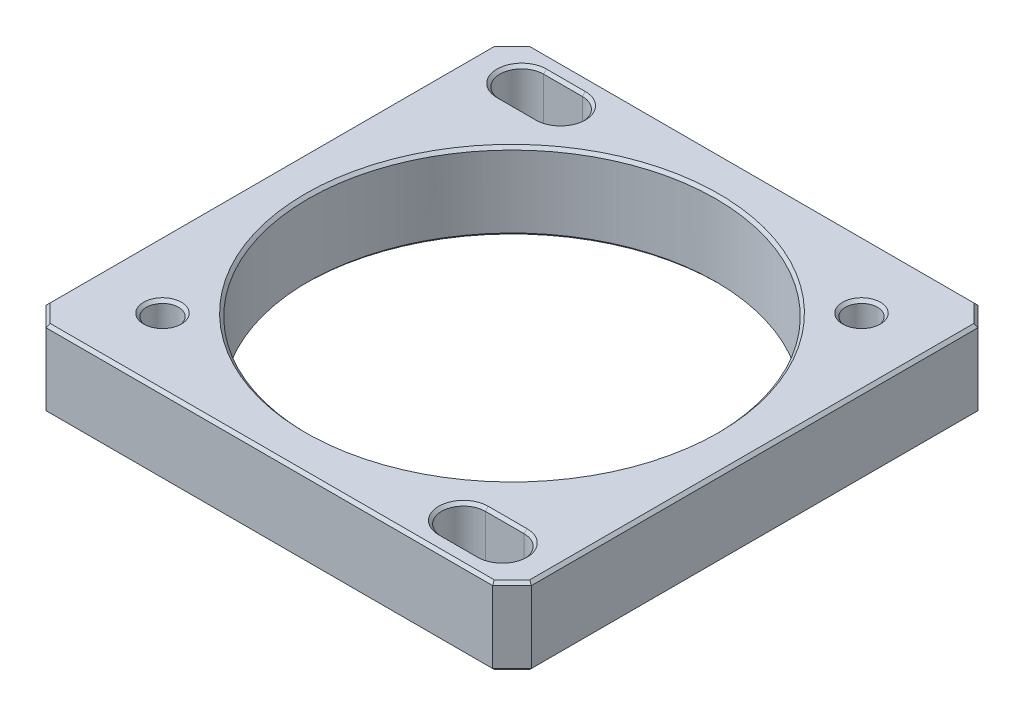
ISO-10303-21;
HEADER;
FILE_DESCRIPTION(('STEP AP214'),'2;1');
FILE_NAME('part.step','',(''),(''),'','','');
FILE_SCHEMA(('AUTOMOTIVE_DESIGN { 1 0 10303 214 1 1 1 1 }'));
ENDSEC;
DATA;
#1=APPLICATION_CONTEXT('core data for automotive mechanical design processes');
#2=APPLICATION_PROTOCOL_DEFINITION('international standard','automotive_design',2000,#1);
#3=PRODUCT_CONTEXT('',#1,'mechanical');
#4=PRODUCT('Part','Part','',(#3));
#5=PRODUCT_RELATED_PRODUCT_CATEGORY('part','',(#4));
#6=PRODUCT_DEFINITION_FORMATION('','',#4);
#7=PRODUCT_DEFINITION_CONTEXT('part definition',#1,'design');
#8=PRODUCT_DEFINITION('design','',#6,#7);
#9=PRODUCT_DEFINITION_SHAPE('','',#8);
#10=(LENGTH_UNIT() NAMED_UNIT(*) SI_UNIT(.MILLI.,.METRE.));
#11=(NAMED_UNIT(*) PLANE_ANGLE_UNIT() SI_UNIT($,.RADIAN.));
#12=(NAMED_UNIT(*) SI_UNIT($,.STERADIAN.) SOLID_ANGLE_UNIT());
#13=UNCERTAINTY_MEASURE_WITH_UNIT(LENGTH_MEASURE(1.E-05),#10,'distance_accuracy_value','');
#14=(GEOMETRIC_REPRESENTATION_CONTEXT(3) GLOBAL_UNCERTAINTY_ASSIGNED_CONTEXT((#13)) GLOBAL_UNIT_ASSIGNED_CONTEXT((#10,
#11,#12)) REPRESENTATION_CONTEXT('',''));
#15=CARTESIAN_POINT('',(0.,0.,0.));
#16=DIRECTION('',(0.,0.,1.));
#17=DIRECTION('',(1.,0.,0.));
#18=AXIS2_PLACEMENT_3D('',#15,#16,#17);
#19=CARTESIAN_POINT('',(0.,8.,0.));
#20=DIRECTION('',(0.,1.,0.));
#21=DIRECTION('',(0.,0.,1.));
#22=AXIS2_PLACEMENT_3D('',#19,#20,#21);
#23=PLANE('',#22);
#24=CARTESIAN_POINT('',(-18.,7.99999999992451,18.));
#25=DIRECTION('',(0.,1.,0.));
#26=DIRECTION('',(0.,0.,1.));
#27=AXIS2_PLACEMENT_3D('',#24,#25,#26);
#28=CIRCLE('',#27,1.94999999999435);
#29=CARTESIAN_POINT('',(-18.,7.99999999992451,19.9499999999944));
#30=VERTEX_POINT('',#29);
#31=EDGE_CURVE('E145',#30,#30,#28,.F.);
#32=ORIENTED_EDGE('',*,*,#31,.T.);
#33=EDGE_LOOP('',(#32));
#34=FACE_BOUND('',#33,.T.);
#35=CARTESIAN_POINT('',(18.,7.99999999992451,-18.));
#36=DIRECTION('',(0.,1.,0.));
#37=DIRECTION('',(0.,0.,1.));
#38=AXIS2_PLACEMENT_3D('',#35,#36,#37);
#39=CIRCLE('',#38,1.94999999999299);
#40=CARTESIAN_POINT('',(18.,7.99999999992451,-16.050000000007));
#41=VERTEX_POINT('',#40);
#42=EDGE_CURVE('E149',#41,#41,#39,.F.);
#43=ORIENTED_EDGE('',*,*,#42,.T.);
#44=EDGE_LOOP('',(#43));
#45=FACE_BOUND('',#44,.T.);
#46=CARTESIAN_POINT('',(16.,8.0000000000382,21.));
#47=DIRECTION('',(0.,1.,0.));
#48=DIRECTION('',(0.,0.,1.));
#49=AXIS2_PLACEMENT_3D('',#46,#47,#48);
#50=CIRCLE('',#49,2.55000000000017);
#51=CARTESIAN_POINT('',(16.,8.0000000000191,23.5500000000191));
#52=VERTEX_POINT('',#51);
#53=CARTESIAN_POINT('',(16.,8.0000000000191,18.4499999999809));
#54=VERTEX_POINT('',#53);
#55=EDGE_CURVE('E113',#52,#54,#50,.F.);
#56=ORIENTED_EDGE('',*,*,#55,.T.);
#57=DIRECTION('',(1.,0.,0.));
#58=VECTOR('',#57,1.);
#59=CARTESIAN_POINT('',(16.,8.,18.45));
#60=LINE('',#59,#58);
#61=CARTESIAN_POINT('',(20.,8.0000000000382,18.449999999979));
#62=VERTEX_POINT('',#61);
#63=EDGE_CURVE('E117',#62,#54,#60,.F.);
#64=ORIENTED_EDGE('',*,*,#63,.F.);
#65=CARTESIAN_POINT('',(20.,8.0000000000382,21.));
#66=DIRECTION('',(0.,1.,0.));
#67=DIRECTION('',(0.,0.,1.));
#68=AXIS2_PLACEMENT_3D('',#65,#66,#67);
#69=CIRCLE('',#68,2.55000000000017);
#70=CARTESIAN_POINT('',(20.,8.0000000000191,23.5500000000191));
#71=VERTEX_POINT('',#70);
#72=EDGE_CURVE('E153',#62,#71,#69,.F.);
#73=ORIENTED_EDGE('',*,*,#72,.T.);
#74=DIRECTION('',(1.,0.,0.));
#75=VECTOR('',#74,1.);
#76=CARTESIAN_POINT('',(16.,8.,23.55));
#77=LINE('',#76,#75);
#78=EDGE_CURVE('E221',#52,#71,#77,.T.);
#79=ORIENTED_EDGE('',*,*,#78,.F.);
#80=EDGE_LOOP('',(#56,#64,#73,#79));
#81=FACE_BOUND('',#80,.T.);
#82=CARTESIAN_POINT('',(-20.,7.99999999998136,-21.));
#83=DIRECTION('',(0.,1.,0.));
#84=DIRECTION('',(0.,0.,1.));
#85=AXIS2_PLACEMENT_3D('',#82,#83,#84);
#86=CIRCLE('',#85,2.54999999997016);
#87=CARTESIAN_POINT('',(-20.,7.99999999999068,-18.4500000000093));
#88=VERTEX_POINT('',#87);
#89=CARTESIAN_POINT('',(-20.,7.99999999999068,-23.5499999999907));
#90=VERTEX_POINT('',#89);
#91=EDGE_CURVE('E84',#88,#90,#86,.F.);
#92=ORIENTED_EDGE('',*,*,#91,.T.);
#93=DIRECTION('',(1.,0.,0.));
#94=VECTOR('',#93,1.);
#95=CARTESIAN_POINT('',(-20.,8.,-23.55));
#96=LINE('',#95,#94);
#97=CARTESIAN_POINT('',(-16.,7.99999999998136,-23.5499999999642));
#98=VERTEX_POINT('',#97);
#99=EDGE_CURVE('E96',#98,#90,#96,.F.);
#100=ORIENTED_EDGE('',*,*,#99,.F.);
#101=CARTESIAN_POINT('',(-16.,7.99999999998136,-21.));
#102=DIRECTION('',(0.,1.,0.));
#103=DIRECTION('',(0.,0.,1.));
#104=AXIS2_PLACEMENT_3D('',#101,#102,#103);
#105=CIRCLE('',#104,2.54999999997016);
#106=CARTESIAN_POINT('',(-16.,7.99999999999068,-18.4500000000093));
#107=VERTEX_POINT('',#106);
#108=EDGE_CURVE('E109',#98,#107,#105,.F.);
#109=ORIENTED_EDGE('',*,*,#108,.T.);
#110=DIRECTION('',(1.,0.,0.));
#111=VECTOR('',#110,1.);
#112=CARTESIAN_POINT('',(-20.,8.,-18.45));
#113=LINE('',#112,#111);
#114=EDGE_CURVE('E102',#88,#107,#113,.T.);
#115=ORIENTED_EDGE('',*,*,#114,.F.);
#116=EDGE_LOOP('',(#92,#100,#109,#115));
#117=FACE_BOUND('',#116,.T.);
#118=DIRECTION('',(0.,0.,1.));
#119=VECTOR('',#118,1.);
#120=CARTESIAN_POINT('',(-24.7,8.,0.));
#121=LINE('',#120,#119);
#122=CARTESIAN_POINT('',(-24.7,8.,22.875735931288));
#123=VERTEX_POINT('',#122);
#124=CARTESIAN_POINT('',(-24.7,8.,-22.875735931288));
#125=VERTEX_POINT('',#124);
#126=EDGE_CURVE('E97',#123,#125,#121,.F.);
#127=ORIENTED_EDGE('',*,*,#126,.F.);
#128=DIRECTION('',(-0.707106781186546,0.,-0.707106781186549));
#129=VECTOR('',#128,1.);
#130=CARTESIAN_POINT('',(-22.875735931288,8.,24.7));
#131=LINE('',#130,#129);
#132=CARTESIAN_POINT('',(-22.875735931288,8.,24.7));
#133=VERTEX_POINT('',#132);
#134=EDGE_CURVE('E216',#133,#123,#131,.T.);
#135=ORIENTED_EDGE('',*,*,#134,.F.);
#136=DIRECTION('',(1.,0.,0.));
#137=VECTOR('',#136,1.);
#138=CARTESIAN_POINT('',(0.,8.,24.7));
#139=LINE('',#138,#137);
#140=CARTESIAN_POINT('',(22.8757359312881,8.,24.7));
#141=VERTEX_POINT('',#140);
#142=EDGE_CURVE('E210',#141,#133,#139,.F.);
#143=ORIENTED_EDGE('',*,*,#142,.F.);
#144=DIRECTION('',(-0.707106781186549,0.,0.707106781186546));
#145=VECTOR('',#144,1.);
#146=CARTESIAN_POINT('',(24.7,8.,22.8757359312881));
#147=LINE('',#146,#145);
#148=CARTESIAN_POINT('',(24.7,8.,22.8757359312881));
#149=VERTEX_POINT('',#148);
#150=EDGE_CURVE('E204',#149,#141,#147,.T.);
#151=ORIENTED_EDGE('',*,*,#150,.F.);
#152=DIRECTION('',(0.,0.,1.));
#153=VECTOR('',#152,1.);
#154=CARTESIAN_POINT('',(24.7,8.,0.));
#155=LINE('',#154,#153);
#156=CARTESIAN_POINT('',(24.7,8.,-22.8757359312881));
#157=VERTEX_POINT('',#156);
#158=EDGE_CURVE('E201',#157,#149,#155,.T.);
#159=ORIENTED_EDGE('',*,*,#158,.F.);
#160=DIRECTION('',(0.707106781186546,0.,0.707106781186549));
#161=VECTOR('',#160,1.);
#162=CARTESIAN_POINT('',(22.8757359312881,8.,-24.7));
#163=LINE('',#162,#161);
#164=CARTESIAN_POINT('',(22.8757359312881,8.,-24.7));
#165=VERTEX_POINT('',#164);
#166=EDGE_CURVE('E195',#165,#157,#163,.T.);
#167=ORIENTED_EDGE('',*,*,#166,.F.);
#168=DIRECTION('',(1.,0.,0.));
#169=VECTOR('',#168,1.);
#170=CARTESIAN_POINT('',(0.,8.,-24.7));
#171=LINE('',#170,#169);
#172=CARTESIAN_POINT('',(-22.8757359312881,8.,-24.7));
#173=VERTEX_POINT('',#172);
#174=EDGE_CURVE('E189',#173,#165,#171,.T.);
#175=ORIENTED_EDGE('',*,*,#174,.F.);
#176=DIRECTION('',(0.707106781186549,0.,-0.707106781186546));
#177=VECTOR('',#176,1.);
#178=CARTESIAN_POINT('',(-24.7,8.,-22.875735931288));
#179=LINE('',#178,#177);
#180=EDGE_CURVE('E180',#125,#173,#179,.T.);
#181=ORIENTED_EDGE('',*,*,#180,.F.);
#182=EDGE_LOOP('',(#127,#135,#143,#151,#159,#167,#175,#181));
#183=FACE_BOUND('',#182,.T.);
#184=CARTESIAN_POINT('',(0.,8.,0.));
#185=DIRECTION('',(0.,1.,0.));
#186=DIRECTION('',(-1.,0.,0.));
#187=AXIS2_PLACEMENT_3D('',#184,#185,#186);
#188=CIRCLE('',#187,21.3);
#189=CARTESIAN_POINT('',(-21.3,8.,0.));
#190=VERTEX_POINT('',#189);
#191=EDGE_CURVE('E20',#190,#190,#188,.F.);
#192=ORIENTED_EDGE('',*,*,#191,.T.);
#193=EDGE_LOOP('',(#192));
#194=FACE_BOUND('',#193,.T.);
#195=ADVANCED_FACE('F17',(#34,#45,#81,#117,#183,#194),#23,.T.);
#196=CARTESIAN_POINT('',(0.,8.,0.));
#197=DIRECTION('',(0.,1.,0.));
#198=DIRECTION('',(-1.,0.,0.));
#199=AXIS2_PLACEMENT_3D('',#196,#197,#198);
#200=CONICAL_SURFACE('',#199,21.3,0.78539816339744);
#201=ORIENTED_EDGE('',*,*,#191,.F.);
#202=EDGE_LOOP('',(#201));
#203=FACE_BOUND('',#202,.T.);
#204=CARTESIAN_POINT('',(0.,7.7,0.));
#205=DIRECTION('',(0.,-1.,0.));
#206=DIRECTION('',(0.,0.,-1.));
#207=AXIS2_PLACEMENT_3D('',#204,#205,#206);
#208=CIRCLE('',#207,21.);
#209=CARTESIAN_POINT('',(0.,7.7,-21.));
#210=VERTEX_POINT('',#209);
#211=EDGE_CURVE('E148',#210,#210,#208,.T.);
#212=ORIENTED_EDGE('',*,*,#211,.T.);
#213=EDGE_LOOP('',(#212));
#214=FACE_BOUND('',#213,.T.);
#215=ADVANCED_FACE('F1239',(#203,#214),#200,.F.);
#216=CARTESIAN_POINT('',(-23.7878679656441,8.,23.787867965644));
#217=DIRECTION('',(-0.5,0.707106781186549,0.499999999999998));
#218=DIRECTION('',(-0.816496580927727,-0.577350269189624,0.));
#219=AXIS2_PLACEMENT_3D('',#216,#217,#218);
#220=PLANE('',#219);
#221=DIRECTION('',(-0.281084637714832,-0.678598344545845,0.678598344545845));
#222=VECTOR('',#221,1.);
#223=CARTESIAN_POINT('',(-22.8757359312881,8.,24.7));
#224=LINE('',#223,#222);
#225=CARTESIAN_POINT('',(-23.,7.69999999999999,25.));
#226=VERTEX_POINT('',#225);
#227=EDGE_CURVE('E213',#133,#226,#224,.T.);
#228=ORIENTED_EDGE('',*,*,#227,.F.);
#229=ORIENTED_EDGE('',*,*,#134,.T.);
#230=DIRECTION('',(0.678598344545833,0.678598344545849,-0.28108463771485));
#231=VECTOR('',#230,1.);
#232=CARTESIAN_POINT('',(-25.,7.69999999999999,23.));
#233=LINE('',#232,#231);
#234=CARTESIAN_POINT('',(-25.,7.69999999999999,23.));
#235=VERTEX_POINT('',#234);
#236=EDGE_CURVE('E174',#235,#123,#233,.T.);
#237=ORIENTED_EDGE('',*,*,#236,.F.);
#238=DIRECTION('',(-0.707106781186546,0.,-0.707106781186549));
#239=VECTOR('',#238,1.);
#240=CARTESIAN_POINT('',(-23.,7.69999999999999,25.));
#241=LINE('',#240,#239);
#242=EDGE_CURVE('E220',#235,#226,#241,.F.);
#243=ORIENTED_EDGE('',*,*,#242,.T.);
#244=EDGE_LOOP('',(#228,#229,#237,#243));
#245=FACE_BOUND('',#244,.T.);
#246=ADVANCED_FACE('F664',(#245),#220,.T.);
#247=CARTESIAN_POINT('',(0.,8.,24.7));
#248=DIRECTION('',(0.,0.707106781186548,0.707106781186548));
#249=DIRECTION('',(0.,-0.707106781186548,0.707106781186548));
#250=AXIS2_PLACEMENT_3D('',#247,#248,#249);
#251=PLANE('',#250);
#252=DIRECTION('',(0.281084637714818,-0.678598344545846,0.678598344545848));
#253=VECTOR('',#252,1.);
#254=CARTESIAN_POINT('',(22.8757359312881,8.,24.7));
#255=LINE('',#254,#253);
#256=CARTESIAN_POINT('',(23.,7.69999999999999,25.));
#257=VERTEX_POINT('',#256);
#258=EDGE_CURVE('E207',#141,#257,#255,.T.);
#259=ORIENTED_EDGE('',*,*,#258,.F.);
#260=ORIENTED_EDGE('',*,*,#142,.T.);
#261=ORIENTED_EDGE('',*,*,#227,.T.);
#262=DIRECTION('',(-1.,0.,0.));
#263=VECTOR('',#262,1.);
#264=CARTESIAN_POINT('',(-25.,7.69999999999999,25.));
#265=LINE('',#264,#263);
#266=EDGE_CURVE('E329',#226,#257,#265,.F.);
#267=ORIENTED_EDGE('',*,*,#266,.T.);
#268=EDGE_LOOP('',(#259,#260,#261,#267));
#269=FACE_BOUND('',#268,.T.);
#270=ADVANCED_FACE('F658',(#269),#251,.T.);
#271=CARTESIAN_POINT('',(23.787867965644,8.,23.7878679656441));
#272=DIRECTION('',(0.499999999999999,0.707106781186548,0.5));
#273=DIRECTION('',(0.,-0.577350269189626,0.816496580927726));
#274=AXIS2_PLACEMENT_3D('',#271,#272,#273);
#275=PLANE('',#274);
#276=DIRECTION('',(0.678598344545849,-0.678598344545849,0.281084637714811));
#277=VECTOR('',#276,1.);
#278=CARTESIAN_POINT('',(24.7,8.,22.8757359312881));
#279=LINE('',#278,#277);
#280=CARTESIAN_POINT('',(25.,7.69999999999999,23.));
#281=VERTEX_POINT('',#280);
#282=EDGE_CURVE('E198',#149,#281,#279,.T.);
#283=ORIENTED_EDGE('',*,*,#282,.F.);
#284=ORIENTED_EDGE('',*,*,#150,.T.);
#285=ORIENTED_EDGE('',*,*,#258,.T.);
#286=DIRECTION('',(-0.707106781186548,0.,0.707106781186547));
#287=VECTOR('',#286,1.);
#288=CARTESIAN_POINT('',(25.,7.69999999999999,23.));
#289=LINE('',#288,#287);
#290=EDGE_CURVE('E323',#257,#281,#289,.F.);
#291=ORIENTED_EDGE('',*,*,#290,.T.);
#292=EDGE_LOOP('',(#283,#284,#285,#291));
#293=FACE_BOUND('',#292,.T.);
#294=ADVANCED_FACE('F711',(#293),#275,.T.);
#295=CARTESIAN_POINT('',(24.7,8.,0.));
#296=DIRECTION('',(0.707106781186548,0.707106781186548,0.));
#297=DIRECTION('',(-0.707106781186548,0.707106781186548,0.));
#298=AXIS2_PLACEMENT_3D('',#295,#296,#297);
#299=PLANE('',#298);
#300=ORIENTED_EDGE('',*,*,#282,.T.);
#301=DIRECTION('',(0.,0.,1.));
#302=VECTOR('',#301,1.);
#303=CARTESIAN_POINT('',(25.,7.69999999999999,-25.));
#304=LINE('',#303,#302);
#305=CARTESIAN_POINT('',(25.,7.69999999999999,-23.));
#306=VERTEX_POINT('',#305);
#307=EDGE_CURVE('E317',#281,#306,#304,.F.);
#308=ORIENTED_EDGE('',*,*,#307,.T.);
#309=DIRECTION('',(0.678598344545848,-0.678598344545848,-0.281084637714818));
#310=VECTOR('',#309,1.);
#311=CARTESIAN_POINT('',(24.7,8.,-22.8757359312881));
#312=LINE('',#311,#310);
#313=EDGE_CURVE('E192',#157,#306,#312,.T.);
#314=ORIENTED_EDGE('',*,*,#313,.F.);
#315=ORIENTED_EDGE('',*,*,#158,.T.);
#316=EDGE_LOOP('',(#300,#308,#314,#315));
#317=FACE_BOUND('',#316,.T.);
#318=ADVANCED_FACE('F715',(#317),#299,.T.);
#319=CARTESIAN_POINT('',(23.7878679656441,8.,-23.787867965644));
#320=DIRECTION('',(0.500000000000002,0.707106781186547,-0.5));
#321=DIRECTION('',(-0.816496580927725,0.577350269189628,0.));
#322=AXIS2_PLACEMENT_3D('',#319,#320,#321);
#323=PLANE('',#322);
#324=ORIENTED_EDGE('',*,*,#313,.T.);
#325=DIRECTION('',(0.707106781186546,0.,0.707106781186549));
#326=VECTOR('',#325,1.);
#327=CARTESIAN_POINT('',(23.,7.69999999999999,-25.));
#328=LINE('',#327,#326);
#329=CARTESIAN_POINT('',(23.,7.69999999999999,-25.));
#330=VERTEX_POINT('',#329);
#331=EDGE_CURVE('E311',#306,#330,#328,.F.);
#332=ORIENTED_EDGE('',*,*,#331,.T.);
#333=DIRECTION('',(0.281084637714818,-0.678598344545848,-0.678598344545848));
#334=VECTOR('',#333,1.);
#335=CARTESIAN_POINT('',(22.8757359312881,8.,-24.7));
#336=LINE('',#335,#334);
#337=EDGE_CURVE('E186',#165,#330,#336,.T.);
#338=ORIENTED_EDGE('',*,*,#337,.F.);
#339=ORIENTED_EDGE('',*,*,#166,.T.);
#340=EDGE_LOOP('',(#324,#332,#338,#339));
#341=FACE_BOUND('',#340,.T.);
#342=ADVANCED_FACE('F1201',(#341),#323,.T.);
#343=CARTESIAN_POINT('',(0.,8.,-24.7));
#344=DIRECTION('',(0.,0.707106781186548,-0.707106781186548));
#345=DIRECTION('',(0.,0.707106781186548,0.707106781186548));
#346=AXIS2_PLACEMENT_3D('',#343,#344,#345);
#347=PLANE('',#346);
#348=ORIENTED_EDGE('',*,*,#337,.T.);
#349=DIRECTION('',(1.,0.,0.));
#350=VECTOR('',#349,1.);
#351=CARTESIAN_POINT('',(-25.,7.69999999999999,-25.));
#352=LINE('',#351,#350);
#353=CARTESIAN_POINT('',(-23.,7.69999999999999,-25.));
#354=VERTEX_POINT('',#353);
#355=EDGE_CURVE('E305',#330,#354,#352,.F.);
#356=ORIENTED_EDGE('',*,*,#355,.T.);
#357=DIRECTION('',(-0.281084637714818,-0.678598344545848,-0.678598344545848));
#358=VECTOR('',#357,1.);
#359=CARTESIAN_POINT('',(-22.8757359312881,8.,-24.7));
#360=LINE('',#359,#358);
#361=EDGE_CURVE('E183',#173,#354,#360,.T.);
#362=ORIENTED_EDGE('',*,*,#361,.F.);
#363=ORIENTED_EDGE('',*,*,#174,.T.);
#364=EDGE_LOOP('',(#348,#356,#362,#363));
#365=FACE_BOUND('',#364,.T.);
#366=ADVANCED_FACE('F1192',(#365),#347,.T.);
#367=CARTESIAN_POINT('',(-23.787867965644,8.,-23.7878679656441));
#368=DIRECTION('',(-0.5,0.707106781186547,-0.500000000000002));
#369=DIRECTION('',(0.,0.577350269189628,0.816496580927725));
#370=AXIS2_PLACEMENT_3D('',#367,#368,#369);
#371=PLANE('',#370);
#372=DIRECTION('',(-0.67859834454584,-0.678598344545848,-0.281084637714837));
#373=VECTOR('',#372,1.);
#374=CARTESIAN_POINT('',(-24.7,8.,-22.875735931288));
#375=LINE('',#374,#373);
#376=CARTESIAN_POINT('',(-25.,7.69999999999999,-23.));
#377=VERTEX_POINT('',#376);
#378=EDGE_CURVE('E177',#125,#377,#375,.T.);
#379=ORIENTED_EDGE('',*,*,#378,.F.);
#380=ORIENTED_EDGE('',*,*,#180,.T.);
#381=ORIENTED_EDGE('',*,*,#361,.T.);
#382=DIRECTION('',(0.707106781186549,0.,-0.707106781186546));
#383=VECTOR('',#382,1.);
#384=CARTESIAN_POINT('',(-25.,7.69999999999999,-23.));
#385=LINE('',#384,#383);
#386=EDGE_CURVE('E299',#354,#377,#385,.F.);
#387=ORIENTED_EDGE('',*,*,#386,.T.);
#388=EDGE_LOOP('',(#379,#380,#381,#387));
#389=FACE_BOUND('',#388,.T.);
#390=ADVANCED_FACE('F1183',(#389),#371,.T.);
#391=CARTESIAN_POINT('',(-24.7,8.,0.));
#392=DIRECTION('',(-0.707106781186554,0.707106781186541,0.));
#393=DIRECTION('',(-0.707106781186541,-0.707106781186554,0.));
#394=AXIS2_PLACEMENT_3D('',#391,#392,#393);
#395=PLANE('',#394);
#396=ORIENTED_EDGE('',*,*,#236,.T.);
#397=ORIENTED_EDGE('',*,*,#126,.T.);
#398=ORIENTED_EDGE('',*,*,#378,.T.);
#399=DIRECTION('',(0.,0.,-1.));
#400=VECTOR('',#399,1.);
#401=CARTESIAN_POINT('',(-25.,7.69999999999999,-25.));
#402=LINE('',#401,#400);
#403=EDGE_CURVE('E293',#377,#235,#402,.F.);
#404=ORIENTED_EDGE('',*,*,#403,.T.);
#405=EDGE_LOOP('',(#396,#397,#398,#404));
#406=FACE_BOUND('',#405,.T.);
#407=ADVANCED_FACE('F1175',(#406),#395,.T.);
#408=CARTESIAN_POINT('',(-20.,7.99999999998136,-21.));
#409=DIRECTION('',(0.,1.,0.));
#410=DIRECTION('',(0.,0.,1.));
#411=AXIS2_PLACEMENT_3D('',#408,#409,#410);
#412=CONICAL_SURFACE('',#411,2.54999999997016,0.785398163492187);
#413=ORIENTED_EDGE('',*,*,#91,.F.);
#414=DIRECTION('',(0.,0.707106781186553,0.707106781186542));
#415=VECTOR('',#414,1.);
#416=CARTESIAN_POINT('',(-20.,7.69999999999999,-18.75));
#417=LINE('',#416,#415);
#418=CARTESIAN_POINT('',(-20.,7.69999999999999,-18.75));
#419=VERTEX_POINT('',#418);
#420=EDGE_CURVE('E89',#419,#88,#417,.T.);
#421=ORIENTED_EDGE('',*,*,#420,.F.);
#422=CARTESIAN_POINT('',(-20.,7.69999999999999,-21.));
#423=DIRECTION('',(0.,1.,0.));
#424=DIRECTION('',(0.,0.,1.));
#425=AXIS2_PLACEMENT_3D('',#422,#423,#424);
#426=CIRCLE('',#425,2.25);
#427=CARTESIAN_POINT('',(-20.,7.69999999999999,-23.25));
#428=VERTEX_POINT('',#427);
#429=EDGE_CURVE('E262',#419,#428,#426,.F.);
#430=ORIENTED_EDGE('',*,*,#429,.T.);
#431=DIRECTION('',(0.,-0.707106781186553,0.707106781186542));
#432=VECTOR('',#431,1.);
#433=CARTESIAN_POINT('',(-20.,7.69999999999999,-23.25));
#434=LINE('',#433,#432);
#435=EDGE_CURVE('E92',#90,#428,#434,.T.);
#436=ORIENTED_EDGE('',*,*,#435,.F.);
#437=EDGE_LOOP('',(#413,#421,#430,#436));
#438=FACE_BOUND('',#437,.T.);
#439=ADVANCED_FACE('F86',(#438),#412,.F.);
#440=CARTESIAN_POINT('',(-20.,7.69999999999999,-23.25));
#441=DIRECTION('',(0.,0.707106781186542,0.707106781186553));
#442=DIRECTION('',(0.,-0.707106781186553,0.707106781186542));
#443=AXIS2_PLACEMENT_3D('',#440,#441,#442);
#444=PLANE('',#443);
#445=ORIENTED_EDGE('',*,*,#435,.T.);
#446=DIRECTION('',(-1.,0.,0.));
#447=VECTOR('',#446,1.);
#448=CARTESIAN_POINT('',(-20.,7.69999999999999,-23.25));
#449=LINE('',#448,#447);
#450=CARTESIAN_POINT('',(-16.,7.70000000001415,-23.2499999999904));
#451=VERTEX_POINT('',#450);
#452=EDGE_CURVE('E264',#428,#451,#449,.F.);
#453=ORIENTED_EDGE('',*,*,#452,.T.);
#454=DIRECTION('',(0.,-0.707106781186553,0.707106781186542));
#455=VECTOR('',#454,1.);
#456=CARTESIAN_POINT('',(-15.9999999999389,499000.,-499015.549999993));
#457=LINE('',#456,#455);
#458=EDGE_CURVE('E106',#451,#98,#457,.F.);
#459=ORIENTED_EDGE('',*,*,#458,.T.);
#460=ORIENTED_EDGE('',*,*,#99,.T.);
#461=EDGE_LOOP('',(#445,#453,#459,#460));
#462=FACE_BOUND('',#461,.T.);
#463=ADVANCED_FACE('F1159',(#462),#444,.T.);
#464=CARTESIAN_POINT('',(-16.,7.99999999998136,-21.));
#465=DIRECTION('',(0.,1.,0.));
#466=DIRECTION('',(0.,0.,1.));
#467=AXIS2_PLACEMENT_3D('',#464,#465,#466);
#468=CONICAL_SURFACE('',#467,2.54999999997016,0.785398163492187);
#469=CARTESIAN_POINT('',(-16.,7.69999999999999,-21.));
#470=DIRECTION('',(0.,1.,0.));
#471=DIRECTION('',(0.,0.,1.));
#472=AXIS2_PLACEMENT_3D('',#469,#470,#471);
#473=CIRCLE('',#472,2.25);
#474=CARTESIAN_POINT('',(-16.,7.69999999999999,-18.75));
#475=VERTEX_POINT('',#474);
#476=EDGE_CURVE('E251',#451,#475,#473,.F.);
#477=ORIENTED_EDGE('',*,*,#476,.T.);
#478=DIRECTION('',(0.,0.707106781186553,0.707106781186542));
#479=VECTOR('',#478,1.);
#480=CARTESIAN_POINT('',(-16.,7.69999999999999,-18.75));
#481=LINE('',#480,#479);
#482=EDGE_CURVE('E111',#107,#475,#481,.F.);
#483=ORIENTED_EDGE('',*,*,#482,.F.);
#484=ORIENTED_EDGE('',*,*,#108,.F.);
#485=ORIENTED_EDGE('',*,*,#458,.F.);
#486=EDGE_LOOP('',(#477,#483,#484,#485));
#487=FACE_BOUND('',#486,.T.);
#488=ADVANCED_FACE('F1151',(#487),#468,.F.);
#489=CARTESIAN_POINT('',(-20.,7.69999999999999,-18.75));
#490=DIRECTION('',(0.,0.707106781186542,-0.707106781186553));
#491=DIRECTION('',(0.,0.707106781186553,0.707106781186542));
#492=AXIS2_PLACEMENT_3D('',#489,#490,#491);
#493=PLANE('',#492);
#494=ORIENTED_EDGE('',*,*,#482,.T.);
#495=DIRECTION('',(1.,0.,0.));
#496=VECTOR('',#495,1.);
#497=CARTESIAN_POINT('',(-20.,7.69999999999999,-18.75));
#498=LINE('',#497,#496);
#499=EDGE_CURVE('E105',#475,#419,#498,.F.);
#500=ORIENTED_EDGE('',*,*,#499,.T.);
#501=ORIENTED_EDGE('',*,*,#420,.T.);
#502=ORIENTED_EDGE('',*,*,#114,.T.);
#503=EDGE_LOOP('',(#494,#500,#501,#502));
#504=FACE_BOUND('',#503,.T.);
#505=ADVANCED_FACE('F101',(#504),#493,.T.);
#506=CARTESIAN_POINT('',(16.,8.0000000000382,21.));
#507=DIRECTION('',(0.,1.,0.));
#508=DIRECTION('',(0.,0.,1.));
#509=AXIS2_PLACEMENT_3D('',#506,#507,#508);
#510=CONICAL_SURFACE('',#509,2.55000000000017,0.785398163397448);
#511=ORIENTED_EDGE('',*,*,#55,.F.);
#512=DIRECTION('',(0.,0.707106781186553,0.707106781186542));
#513=VECTOR('',#512,1.);
#514=CARTESIAN_POINT('',(16.,7.69999999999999,23.25));
#515=LINE('',#514,#513);
#516=CARTESIAN_POINT('',(16.,7.69999999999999,23.25));
#517=VERTEX_POINT('',#516);
#518=EDGE_CURVE('E222',#517,#52,#515,.T.);
#519=ORIENTED_EDGE('',*,*,#518,.F.);
#520=CARTESIAN_POINT('',(16.,7.69999999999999,21.));
#521=DIRECTION('',(0.,1.,0.));
#522=DIRECTION('',(0.,0.,1.));
#523=AXIS2_PLACEMENT_3D('',#520,#521,#522);
#524=CIRCLE('',#523,2.25);
#525=CARTESIAN_POINT('',(16.,7.69999999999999,18.75));
#526=VERTEX_POINT('',#525);
#527=EDGE_CURVE('E242',#517,#526,#524,.F.);
#528=ORIENTED_EDGE('',*,*,#527,.T.);
#529=DIRECTION('',(0.,-0.707106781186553,0.707106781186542));
#530=VECTOR('',#529,1.);
#531=CARTESIAN_POINT('',(16.,7.69999999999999,18.75));
#532=LINE('',#531,#530);
#533=EDGE_CURVE('E157',#54,#526,#532,.T.);
#534=ORIENTED_EDGE('',*,*,#533,.F.);
#535=EDGE_LOOP('',(#511,#519,#528,#534));
#536=FACE_BOUND('',#535,.T.);
#537=ADVANCED_FACE('F1135',(#536),#510,.F.);
#538=CARTESIAN_POINT('',(16.,7.69999999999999,18.75));
#539=DIRECTION('',(0.,0.707106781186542,0.707106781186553));
#540=DIRECTION('',(0.,-0.707106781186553,0.707106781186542));
#541=AXIS2_PLACEMENT_3D('',#538,#539,#540);
#542=PLANE('',#541);
#543=ORIENTED_EDGE('',*,*,#533,.T.);
#544=DIRECTION('',(-1.,0.,0.));
#545=VECTOR('',#544,1.);
#546=CARTESIAN_POINT('',(16.,7.69999999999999,18.75));
#547=LINE('',#546,#545);
#548=CARTESIAN_POINT('',(20.,7.69999999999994,18.7500000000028));
#549=VERTEX_POINT('',#548);
#550=EDGE_CURVE('E238',#526,#549,#547,.F.);
#551=ORIENTED_EDGE('',*,*,#550,.T.);
#552=DIRECTION('',(0.,-0.707106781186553,0.707106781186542));
#553=VECTOR('',#552,1.);
#554=CARTESIAN_POINT('',(20.0000000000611,498984.450000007,-498958.));
#555=LINE('',#554,#553);
#556=EDGE_CURVE('E156',#549,#62,#555,.F.);
#557=ORIENTED_EDGE('',*,*,#556,.T.);
#558=ORIENTED_EDGE('',*,*,#63,.T.);
#559=EDGE_LOOP('',(#543,#551,#557,#558));
#560=FACE_BOUND('',#559,.T.);
#561=ADVANCED_FACE('F1126',(#560),#542,.T.);
#562=CARTESIAN_POINT('',(20.,8.0000000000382,21.));
#563=DIRECTION('',(0.,1.,0.));
#564=DIRECTION('',(0.,0.,1.));
#565=AXIS2_PLACEMENT_3D('',#562,#563,#564);
#566=CONICAL_SURFACE('',#565,2.55000000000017,0.785398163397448);
#567=CARTESIAN_POINT('',(20.,7.69999999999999,21.));
#568=DIRECTION('',(0.,1.,0.));
#569=DIRECTION('',(0.,0.,1.));
#570=AXIS2_PLACEMENT_3D('',#567,#568,#569);
#571=CIRCLE('',#570,2.25);
#572=CARTESIAN_POINT('',(20.,7.69999999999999,23.25));
#573=VERTEX_POINT('',#572);
#574=EDGE_CURVE('E345',#549,#573,#571,.F.);
#575=ORIENTED_EDGE('',*,*,#574,.T.);
#576=DIRECTION('',(0.,0.707106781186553,0.707106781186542));
#577=VECTOR('',#576,1.);
#578=CARTESIAN_POINT('',(20.,7.69999999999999,23.25));
#579=LINE('',#578,#577);
#580=EDGE_CURVE('E152',#71,#573,#579,.F.);
#581=ORIENTED_EDGE('',*,*,#580,.F.);
#582=ORIENTED_EDGE('',*,*,#72,.F.);
#583=ORIENTED_EDGE('',*,*,#556,.F.);
#584=EDGE_LOOP('',(#575,#581,#582,#583));
#585=FACE_BOUND('',#584,.T.);
#586=ADVANCED_FACE('F1118',(#585),#566,.F.);
#587=CARTESIAN_POINT('',(16.,7.69999999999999,23.25));
#588=DIRECTION('',(0.,0.707106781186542,-0.707106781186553));
#589=DIRECTION('',(0.,0.707106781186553,0.707106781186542));
#590=AXIS2_PLACEMENT_3D('',#587,#588,#589);
#591=PLANE('',#590);
#592=ORIENTED_EDGE('',*,*,#580,.T.);
#593=DIRECTION('',(1.,0.,0.));
#594=VECTOR('',#593,1.);
#595=CARTESIAN_POINT('',(16.,7.69999999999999,23.25));
#596=LINE('',#595,#594);
#597=EDGE_CURVE('E351',#573,#517,#596,.F.);
#598=ORIENTED_EDGE('',*,*,#597,.T.);
#599=ORIENTED_EDGE('',*,*,#518,.T.);
#600=ORIENTED_EDGE('',*,*,#78,.T.);
#601=EDGE_LOOP('',(#592,#598,#599,#600));
#602=FACE_BOUND('',#601,.T.);
#603=ADVANCED_FACE('F1109',(#602),#591,.T.);
#604=CARTESIAN_POINT('',(18.,7.99999999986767,-18.));
#605=DIRECTION('',(0.,1.,0.));
#606=DIRECTION('',(0.,0.,1.));
#607=AXIS2_PLACEMENT_3D('',#604,#605,#606);
#608=CONICAL_SURFACE('',#607,1.94999999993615,0.785398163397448);
#609=ORIENTED_EDGE('',*,*,#42,.F.);
#610=EDGE_LOOP('',(#609));
#611=FACE_BOUND('',#610,.T.);
#612=CARTESIAN_POINT('',(18.,7.7,-18.));
#613=DIRECTION('',(0.,1.,0.));
#614=DIRECTION('',(0.,0.,1.));
#615=AXIS2_PLACEMENT_3D('',#612,#613,#614);
#616=CIRCLE('',#615,1.65);
#617=CARTESIAN_POINT('',(18.,7.7,-16.35));
#618=VERTEX_POINT('',#617);
#619=EDGE_CURVE('E341',#618,#618,#616,.F.);
#620=ORIENTED_EDGE('',*,*,#619,.T.);
#621=EDGE_LOOP('',(#620));
#622=FACE_BOUND('',#621,.T.);
#623=ADVANCED_FACE('F1100',(#611,#622),#608,.F.);
#624=CARTESIAN_POINT('',(-18.,7.99999999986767,18.));
#625=DIRECTION('',(0.,1.,0.));
#626=DIRECTION('',(0.,0.,1.));
#627=AXIS2_PLACEMENT_3D('',#624,#625,#626);
#628=CONICAL_SURFACE('',#627,1.94999999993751,0.785398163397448);
#629=ORIENTED_EDGE('',*,*,#31,.F.);
#630=EDGE_LOOP('',(#629));
#631=FACE_BOUND('',#630,.T.);
#632=CARTESIAN_POINT('',(-18.,7.7,18.));
#633=DIRECTION('',(0.,1.,0.));
#634=DIRECTION('',(0.,0.,1.));
#635=AXIS2_PLACEMENT_3D('',#632,#633,#634);
#636=CIRCLE('',#635,1.65);
#637=CARTESIAN_POINT('',(-18.,7.7,19.65));
#638=VERTEX_POINT('',#637);
#639=EDGE_CURVE('E338',#638,#638,#636,.F.);
#640=ORIENTED_EDGE('',*,*,#639,.T.);
#641=EDGE_LOOP('',(#640));
#642=FACE_BOUND('',#641,.T.);
#643=ADVANCED_FACE('F1091',(#631,#642),#628,.F.);
#644=CARTESIAN_POINT('',(0.,8.,0.));
#645=DIRECTION('',(0.,-1.,0.));
#646=DIRECTION('',(0.,0.,-1.));
#647=AXIS2_PLACEMENT_3D('',#644,#645,#646);
#648=CYLINDRICAL_SURFACE('',#647,21.);
#649=CARTESIAN_POINT('',(0.,0.300000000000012,0.));
#650=DIRECTION('',(0.,-1.,0.));
#651=DIRECTION('',(0.,0.,-1.));
#652=AXIS2_PLACEMENT_3D('',#649,#650,#651);
#653=CIRCLE('',#652,21.);
#654=CARTESIAN_POINT('',(0.,0.300000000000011,-21.));
#655=VERTEX_POINT('',#654);
#656=EDGE_CURVE('E334',#655,#655,#653,.T.);
#657=ORIENTED_EDGE('',*,*,#656,.T.);
#658=EDGE_LOOP('',(#657));
#659=FACE_BOUND('',#658,.T.);
#660=ORIENTED_EDGE('',*,*,#211,.F.);
#661=EDGE_LOOP('',(#660));
#662=FACE_BOUND('',#661,.T.);
#663=ADVANCED_FACE('F1083',(#659,#662),#648,.F.);
#664=CARTESIAN_POINT('',(-23.,8.,25.));
#665=DIRECTION('',(0.707106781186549,0.,-0.707106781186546));
#666=DIRECTION('',(-0.707106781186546,0.,-0.707106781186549));
#667=AXIS2_PLACEMENT_3D('',#664,#665,#666);
#668=PLANE('',#667);
#669=DIRECTION('',(0.707106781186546,0.,0.707106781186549));
#670=VECTOR('',#669,1.);
#671=CARTESIAN_POINT('',(-25.,0.299999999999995,23.));
#672=LINE('',#671,#670);
#673=CARTESIAN_POINT('',(-25.,0.299999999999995,23.));
#674=VERTEX_POINT('',#673);
#675=CARTESIAN_POINT('',(-23.,0.299999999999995,25.));
#676=VERTEX_POINT('',#675);
#677=EDGE_CURVE('E337',#674,#676,#672,.T.);
#678=ORIENTED_EDGE('',*,*,#677,.T.);
#679=DIRECTION('',(0.,1.,0.));
#680=VECTOR('',#679,1.);
#681=CARTESIAN_POINT('',(-23.,8.,25.));
#682=LINE('',#681,#680);
#683=EDGE_CURVE('E326',#676,#226,#682,.T.);
#684=ORIENTED_EDGE('',*,*,#683,.T.);
#685=ORIENTED_EDGE('',*,*,#242,.F.);
#686=DIRECTION('',(0.,1.,0.));
#687=VECTOR('',#686,1.);
#688=CARTESIAN_POINT('',(-25.,8.,23.));
#689=LINE('',#688,#687);
#690=EDGE_CURVE('E290',#235,#674,#689,.F.);
#691=ORIENTED_EDGE('',*,*,#690,.T.);
#692=EDGE_LOOP('',(#678,#684,#685,#691));
#693=FACE_BOUND('',#692,.T.);
#694=ADVANCED_FACE('F666',(#693),#668,.F.);
#695=CARTESIAN_POINT('',(-25.,8.,25.));
#696=DIRECTION('',(0.,0.,-1.));
#697=DIRECTION('',(-1.,0.,0.));
#698=AXIS2_PLACEMENT_3D('',#695,#696,#697);
#699=PLANE('',#698);
#700=DIRECTION('',(1.,0.,0.));
#701=VECTOR('',#700,1.);
#702=CARTESIAN_POINT('',(-25.,0.299999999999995,25.));
#703=LINE('',#702,#701);
#704=CARTESIAN_POINT('',(23.,0.299999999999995,25.));
#705=VERTEX_POINT('',#704);
#706=EDGE_CURVE('E474',#676,#705,#703,.T.);
#707=ORIENTED_EDGE('',*,*,#706,.T.);
#708=DIRECTION('',(0.,1.,0.));
#709=VECTOR('',#708,1.);
#710=CARTESIAN_POINT('',(23.,8.,25.));
#711=LINE('',#710,#709);
#712=EDGE_CURVE('E320',#705,#257,#711,.T.);
#713=ORIENTED_EDGE('',*,*,#712,.T.);
#714=ORIENTED_EDGE('',*,*,#266,.F.);
#715=ORIENTED_EDGE('',*,*,#683,.F.);
#716=EDGE_LOOP('',(#707,#713,#714,#715));
#717=FACE_BOUND('',#716,.T.);
#718=ADVANCED_FACE('F662',(#717),#699,.F.);
#719=CARTESIAN_POINT('',(25.,8.,23.));
#720=DIRECTION('',(-0.707106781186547,0.,-0.707106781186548));
#721=DIRECTION('',(-0.707106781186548,0.,0.707106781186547));
#722=AXIS2_PLACEMENT_3D('',#719,#720,#721);
#723=PLANE('',#722);
#724=DIRECTION('',(0.707106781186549,0.,-0.707106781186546));
#725=VECTOR('',#724,1.);
#726=CARTESIAN_POINT('',(23.,0.299999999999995,25.));
#727=LINE('',#726,#725);
#728=CARTESIAN_POINT('',(25.,0.299999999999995,23.));
#729=VERTEX_POINT('',#728);
#730=EDGE_CURVE('E468',#705,#729,#727,.T.);
#731=ORIENTED_EDGE('',*,*,#730,.T.);
#732=DIRECTION('',(0.,1.,0.));
#733=VECTOR('',#732,1.);
#734=CARTESIAN_POINT('',(25.,8.,23.));
#735=LINE('',#734,#733);
#736=EDGE_CURVE('E314',#729,#281,#735,.T.);
#737=ORIENTED_EDGE('',*,*,#736,.T.);
#738=ORIENTED_EDGE('',*,*,#290,.F.);
#739=ORIENTED_EDGE('',*,*,#712,.F.);
#740=EDGE_LOOP('',(#731,#737,#738,#739));
#741=FACE_BOUND('',#740,.T.);
#742=ADVANCED_FACE('F709',(#741),#723,.F.);
#743=CARTESIAN_POINT('',(25.,8.,-25.));
#744=DIRECTION('',(-1.,0.,0.));
#745=DIRECTION('',(0.,0.,1.));
#746=AXIS2_PLACEMENT_3D('',#743,#744,#745);
#747=PLANE('',#746);
#748=DIRECTION('',(0.,0.,1.));
#749=VECTOR('',#748,1.);
#750=CARTESIAN_POINT('',(25.,0.299999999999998,-25.));
#751=LINE('',#750,#749);
#752=CARTESIAN_POINT('',(25.,0.299999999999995,-23.));
#753=VERTEX_POINT('',#752);
#754=EDGE_CURVE('E465',#729,#753,#751,.F.);
#755=ORIENTED_EDGE('',*,*,#754,.T.);
#756=DIRECTION('',(0.,1.,0.));
#757=VECTOR('',#756,1.);
#758=CARTESIAN_POINT('',(25.,8.,-23.));
#759=LINE('',#758,#757);
#760=EDGE_CURVE('E308',#753,#306,#759,.T.);
#761=ORIENTED_EDGE('',*,*,#760,.T.);
#762=ORIENTED_EDGE('',*,*,#307,.F.);
#763=ORIENTED_EDGE('',*,*,#736,.F.);
#764=EDGE_LOOP('',(#755,#761,#762,#763));
#765=FACE_BOUND('',#764,.T.);
#766=ADVANCED_FACE('F719',(#765),#747,.F.);
#767=CARTESIAN_POINT('',(23.,8.,-25.));
#768=DIRECTION('',(-0.707106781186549,0.,0.707106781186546));
#769=DIRECTION('',(0.707106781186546,0.,0.707106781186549));
#770=AXIS2_PLACEMENT_3D('',#767,#768,#769);
#771=PLANE('',#770);
#772=DIRECTION('',(-0.707106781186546,0.,-0.707106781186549));
#773=VECTOR('',#772,1.);
#774=CARTESIAN_POINT('',(25.,0.299999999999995,-23.));
#775=LINE('',#774,#773);
#776=CARTESIAN_POINT('',(23.,0.299999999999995,-25.));
#777=VERTEX_POINT('',#776);
#778=EDGE_CURVE('E459',#753,#777,#775,.T.);
#779=ORIENTED_EDGE('',*,*,#778,.T.);
#780=DIRECTION('',(0.,1.,0.));
#781=VECTOR('',#780,1.);
#782=CARTESIAN_POINT('',(23.,8.,-25.));
#783=LINE('',#782,#781);
#784=EDGE_CURVE('E302',#777,#330,#783,.T.);
#785=ORIENTED_EDGE('',*,*,#784,.T.);
#786=ORIENTED_EDGE('',*,*,#331,.F.);
#787=ORIENTED_EDGE('',*,*,#760,.F.);
#788=EDGE_LOOP('',(#779,#785,#786,#787));
#789=FACE_BOUND('',#788,.T.);
#790=ADVANCED_FACE('F724',(#789),#771,.F.);
#791=CARTESIAN_POINT('',(-25.,8.,-25.));
#792=DIRECTION('',(0.,0.,1.));
#793=DIRECTION('',(1.,0.,0.));
#794=AXIS2_PLACEMENT_3D('',#791,#792,#793);
#795=PLANE('',#794);
#796=DIRECTION('',(1.,0.,0.));
#797=VECTOR('',#796,1.);
#798=CARTESIAN_POINT('',(-25.,0.299999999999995,-25.));
#799=LINE('',#798,#797);
#800=CARTESIAN_POINT('',(-23.,0.299999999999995,-25.));
#801=VERTEX_POINT('',#800);
#802=EDGE_CURVE('E453',#777,#801,#799,.F.);
#803=ORIENTED_EDGE('',*,*,#802,.T.);
#804=DIRECTION('',(0.,1.,0.));
#805=VECTOR('',#804,1.);
#806=CARTESIAN_POINT('',(-23.,8.,-25.));
#807=LINE('',#806,#805);
#808=EDGE_CURVE('E296',#801,#354,#807,.T.);
#809=ORIENTED_EDGE('',*,*,#808,.T.);
#810=ORIENTED_EDGE('',*,*,#355,.F.);
#811=ORIENTED_EDGE('',*,*,#784,.F.);
#812=EDGE_LOOP('',(#803,#809,#810,#811));
#813=FACE_BOUND('',#812,.T.);
#814=ADVANCED_FACE('F1038',(#813),#795,.F.);
#815=CARTESIAN_POINT('',(-25.,8.,-23.));
#816=DIRECTION('',(0.707106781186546,0.,0.707106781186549));
#817=DIRECTION('',(0.707106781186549,0.,-0.707106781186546));
#818=AXIS2_PLACEMENT_3D('',#815,#816,#817);
#819=PLANE('',#818);
#820=DIRECTION('',(-0.707106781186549,0.,0.707106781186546));
#821=VECTOR('',#820,1.);
#822=CARTESIAN_POINT('',(-23.,0.299999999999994,-25.));
#823=LINE('',#822,#821);
#824=CARTESIAN_POINT('',(-25.,0.299999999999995,-23.));
#825=VERTEX_POINT('',#824);
#826=EDGE_CURVE('E444',#801,#825,#823,.T.);
#827=ORIENTED_EDGE('',*,*,#826,.T.);
#828=DIRECTION('',(0.,1.,0.));
#829=VECTOR('',#828,1.);
#830=CARTESIAN_POINT('',(-25.,8.,-23.));
#831=LINE('',#830,#829);
#832=EDGE_CURVE('E265',#825,#377,#831,.T.);
#833=ORIENTED_EDGE('',*,*,#832,.T.);
#834=ORIENTED_EDGE('',*,*,#386,.F.);
#835=ORIENTED_EDGE('',*,*,#808,.F.);
#836=EDGE_LOOP('',(#827,#833,#834,#835));
#837=FACE_BOUND('',#836,.T.);
#838=ADVANCED_FACE('F1029',(#837),#819,.F.);
#839=CARTESIAN_POINT('',(-25.,8.,-25.));
#840=DIRECTION('',(1.,0.,0.));
#841=DIRECTION('',(0.,0.,-1.));
#842=AXIS2_PLACEMENT_3D('',#839,#840,#841);
#843=PLANE('',#842);
#844=DIRECTION('',(0.,0.,1.));
#845=VECTOR('',#844,1.);
#846=CARTESIAN_POINT('',(-25.,0.299999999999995,-25.));
#847=LINE('',#846,#845);
#848=EDGE_CURVE('E402',#825,#674,#847,.T.);
#849=ORIENTED_EDGE('',*,*,#848,.T.);
#850=ORIENTED_EDGE('',*,*,#690,.F.);
#851=ORIENTED_EDGE('',*,*,#403,.F.);
#852=ORIENTED_EDGE('',*,*,#832,.F.);
#853=EDGE_LOOP('',(#849,#850,#851,#852));
#854=FACE_BOUND('',#853,.T.);
#855=ADVANCED_FACE('F1021',(#854),#843,.F.);
#856=CARTESIAN_POINT('',(-20.,0.,-21.));
#857=DIRECTION('',(0.,1.,0.));
#858=DIRECTION('',(0.,0.,1.));
#859=AXIS2_PLACEMENT_3D('',#856,#857,#858);
#860=CYLINDRICAL_SURFACE('',#859,2.25);
#861=CARTESIAN_POINT('',(-20.,0.300000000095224,-21.));
#862=DIRECTION('',(0.,-1.,0.));
#863=DIRECTION('',(0.,0.,-1.));
#864=AXIS2_PLACEMENT_3D('',#861,#862,#863);
#865=CIRCLE('',#864,2.25000000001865);
#866=CARTESIAN_POINT('',(-20.,0.300000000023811,-18.7499999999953));
#867=VERTEX_POINT('',#866);
#868=CARTESIAN_POINT('',(-20.,0.300000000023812,-23.2500000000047));
#869=VERTEX_POINT('',#868);
#870=EDGE_CURVE('E390',#867,#869,#865,.T.);
#871=ORIENTED_EDGE('',*,*,#870,.T.);
#872=DIRECTION('',(0.,1.,0.));
#873=VECTOR('',#872,1.);
#874=CARTESIAN_POINT('',(-20.,0.,-23.25));
#875=LINE('',#874,#873);
#876=EDGE_CURVE('E255',#869,#428,#875,.T.);
#877=ORIENTED_EDGE('',*,*,#876,.T.);
#878=ORIENTED_EDGE('',*,*,#429,.F.);
#879=DIRECTION('',(0.,1.,0.));
#880=VECTOR('',#879,1.);
#881=CARTESIAN_POINT('',(-20.,0.,-18.75));
#882=LINE('',#881,#880);
#883=EDGE_CURVE('E259',#419,#867,#882,.F.);
#884=ORIENTED_EDGE('',*,*,#883,.T.);
#885=EDGE_LOOP('',(#871,#877,#878,#884));
#886=FACE_BOUND('',#885,.T.);
#887=ADVANCED_FACE('F1013',(#886),#860,.F.);
#888=CARTESIAN_POINT('',(-20.,0.,-23.25));
#889=DIRECTION('',(0.,0.,-1.));
#890=DIRECTION('',(-1.,0.,0.));
#891=AXIS2_PLACEMENT_3D('',#888,#889,#890);
#892=PLANE('',#891);
#893=DIRECTION('',(1.,0.,0.));
#894=VECTOR('',#893,1.);
#895=CARTESIAN_POINT('',(0.,0.300000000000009,-23.25));
#896=LINE('',#895,#894);
#897=CARTESIAN_POINT('',(-16.,0.300000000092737,-23.2499999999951));
#898=VERTEX_POINT('',#897);
#899=EDGE_CURVE('E387',#869,#898,#896,.T.);
#900=ORIENTED_EDGE('',*,*,#899,.T.);
#901=DIRECTION('',(0.,1.,0.));
#902=VECTOR('',#901,1.);
#903=CARTESIAN_POINT('',(-16.,0.,-23.25));
#904=LINE('',#903,#902);
#905=EDGE_CURVE('E254',#898,#451,#904,.T.);
#906=ORIENTED_EDGE('',*,*,#905,.T.);
#907=ORIENTED_EDGE('',*,*,#452,.F.);
#908=ORIENTED_EDGE('',*,*,#876,.F.);
#909=EDGE_LOOP('',(#900,#906,#907,#908));
#910=FACE_BOUND('',#909,.T.);
#911=ADVANCED_FACE('F1005',(#910),#892,.F.);
#912=CARTESIAN_POINT('',(-16.,0.,-21.));
#913=DIRECTION('',(0.,1.,0.));
#914=DIRECTION('',(0.,0.,1.));
#915=AXIS2_PLACEMENT_3D('',#912,#913,#914);
#916=CYLINDRICAL_SURFACE('',#915,2.25);
#917=CARTESIAN_POINT('',(-16.,0.300000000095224,-21.));
#918=DIRECTION('',(0.,-1.,0.));
#919=DIRECTION('',(0.,0.,-1.));
#920=AXIS2_PLACEMENT_3D('',#917,#918,#919);
#921=CIRCLE('',#920,2.25000000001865);
#922=CARTESIAN_POINT('',(-16.,0.30000000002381,-18.7499999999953));
#923=VERTEX_POINT('',#922);
#924=EDGE_CURVE('E379',#898,#923,#921,.T.);
#925=ORIENTED_EDGE('',*,*,#924,.T.);
#926=DIRECTION('',(0.,1.,0.));
#927=VECTOR('',#926,1.);
#928=CARTESIAN_POINT('',(-16.,0.,-18.75));
#929=LINE('',#928,#927);
#930=EDGE_CURVE('E358',#923,#475,#929,.T.);
#931=ORIENTED_EDGE('',*,*,#930,.T.);
#932=ORIENTED_EDGE('',*,*,#476,.F.);
#933=ORIENTED_EDGE('',*,*,#905,.F.);
#934=EDGE_LOOP('',(#925,#931,#932,#933));
#935=FACE_BOUND('',#934,.T.);
#936=ADVANCED_FACE('F997',(#935),#916,.F.);
#937=CARTESIAN_POINT('',(-20.,0.,-18.75));
#938=DIRECTION('',(0.,0.,1.));
#939=DIRECTION('',(1.,0.,0.));
#940=AXIS2_PLACEMENT_3D('',#937,#938,#939);
#941=PLANE('',#940);
#942=DIRECTION('',(1.,0.,0.));
#943=VECTOR('',#942,1.);
#944=CARTESIAN_POINT('',(0.,0.300000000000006,-18.75));
#945=LINE('',#944,#943);
#946=EDGE_CURVE('E410',#923,#867,#945,.F.);
#947=ORIENTED_EDGE('',*,*,#946,.T.);
#948=ORIENTED_EDGE('',*,*,#883,.F.);
#949=ORIENTED_EDGE('',*,*,#499,.F.);
#950=ORIENTED_EDGE('',*,*,#930,.F.);
#951=EDGE_LOOP('',(#947,#948,#949,#950));
#952=FACE_BOUND('',#951,.T.);
#953=ADVANCED_FACE('F989',(#952),#941,.F.);
#954=CARTESIAN_POINT('',(16.,0.,21.));
#955=DIRECTION('',(0.,1.,0.));
#956=DIRECTION('',(0.,0.,1.));
#957=AXIS2_PLACEMENT_3D('',#954,#955,#956);
#958=CYLINDRICAL_SURFACE('',#957,2.25);
#959=CARTESIAN_POINT('',(16.,0.300000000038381,21.));
#960=DIRECTION('',(0.,-1.,0.));
#961=DIRECTION('',(0.,0.,-1.));
#962=AXIS2_PLACEMENT_3D('',#959,#960,#961);
#963=CIRCLE('',#962,2.25000000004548);
#964=CARTESIAN_POINT('',(16.,0.300000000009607,23.2500000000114));
#965=VERTEX_POINT('',#964);
#966=CARTESIAN_POINT('',(16.,0.300000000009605,18.7499999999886));
#967=VERTEX_POINT('',#966);
#968=EDGE_CURVE('E419',#965,#967,#963,.T.);
#969=ORIENTED_EDGE('',*,*,#968,.T.);
#970=DIRECTION('',(0.,1.,0.));
#971=VECTOR('',#970,1.);
#972=CARTESIAN_POINT('',(16.,0.,18.75));
#973=LINE('',#972,#971);
#974=EDGE_CURVE('E241',#967,#526,#973,.T.);
#975=ORIENTED_EDGE('',*,*,#974,.T.);
#976=ORIENTED_EDGE('',*,*,#527,.F.);
#977=DIRECTION('',(0.,1.,0.));
#978=VECTOR('',#977,1.);
#979=CARTESIAN_POINT('',(16.,0.,23.25));
#980=LINE('',#979,#978);
#981=EDGE_CURVE('E353',#517,#965,#980,.F.);
#982=ORIENTED_EDGE('',*,*,#981,.T.);
#983=EDGE_LOOP('',(#969,#975,#976,#982));
#984=FACE_BOUND('',#983,.T.);
#985=ADVANCED_FACE('F522',(#984),#958,.F.);
#986=CARTESIAN_POINT('',(16.,0.,18.75));
#987=DIRECTION('',(0.,0.,-1.));
#988=DIRECTION('',(-1.,0.,0.));
#989=AXIS2_PLACEMENT_3D('',#986,#987,#988);
#990=PLANE('',#989);
#991=DIRECTION('',(1.,0.,0.));
#992=VECTOR('',#991,1.);
#993=CARTESIAN_POINT('',(0.,0.300000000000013,18.75));
#994=LINE('',#993,#992);
#995=CARTESIAN_POINT('',(20.,0.300000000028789,18.7499999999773));
#996=VERTEX_POINT('',#995);
#997=EDGE_CURVE('E490',#967,#996,#994,.T.);
#998=ORIENTED_EDGE('',*,*,#997,.T.);
#999=DIRECTION('',(0.,1.,0.));
#1000=VECTOR('',#999,1.);
#1001=CARTESIAN_POINT('',(20.,0.,18.75));
#1002=LINE('',#1001,#1000);
#1003=EDGE_CURVE('E348',#996,#549,#1002,.T.);
#1004=ORIENTED_EDGE('',*,*,#1003,.T.);
#1005=ORIENTED_EDGE('',*,*,#550,.F.);
#1006=ORIENTED_EDGE('',*,*,#974,.F.);
#1007=EDGE_LOOP('',(#998,#1004,#1005,#1006));
#1008=FACE_BOUND('',#1007,.T.);
#1009=ADVANCED_FACE('F532',(#1008),#990,.F.);
#1010=CARTESIAN_POINT('',(20.,0.,21.));
#1011=DIRECTION('',(0.,1.,0.));
#1012=DIRECTION('',(0.,0.,1.));
#1013=AXIS2_PLACEMENT_3D('',#1010,#1011,#1012);
#1014=CYLINDRICAL_SURFACE('',#1013,2.25);
#1015=CARTESIAN_POINT('',(20.,0.300000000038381,21.));
#1016=DIRECTION('',(0.,-1.,0.));
#1017=DIRECTION('',(0.,0.,-1.));
#1018=AXIS2_PLACEMENT_3D('',#1015,#1016,#1017);
#1019=CIRCLE('',#1018,2.25000000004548);
#1020=CARTESIAN_POINT('',(20.,0.300000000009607,23.2500000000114));
#1021=VERTEX_POINT('',#1020);
#1022=EDGE_CURVE('E506',#996,#1021,#1019,.T.);
#1023=ORIENTED_EDGE('',*,*,#1022,.T.);
#1024=DIRECTION('',(0.,1.,0.));
#1025=VECTOR('',#1024,1.);
#1026=CARTESIAN_POINT('',(20.,0.,23.25));
#1027=LINE('',#1026,#1025);
#1028=EDGE_CURVE('E344',#1021,#573,#1027,.T.);
#1029=ORIENTED_EDGE('',*,*,#1028,.T.);
#1030=ORIENTED_EDGE('',*,*,#574,.F.);
#1031=ORIENTED_EDGE('',*,*,#1003,.F.);
#1032=EDGE_LOOP('',(#1023,#1029,#1030,#1031));
#1033=FACE_BOUND('',#1032,.T.);
#1034=ADVANCED_FACE('F966',(#1033),#1014,.F.);
#1035=CARTESIAN_POINT('',(16.,0.,23.25));
#1036=DIRECTION('',(0.,0.,1.));
#1037=DIRECTION('',(1.,0.,0.));
#1038=AXIS2_PLACEMENT_3D('',#1035,#1036,#1037);
#1039=PLANE('',#1038);
#1040=DIRECTION('',(1.,0.,0.));
#1041=VECTOR('',#1040,1.);
#1042=CARTESIAN_POINT('',(0.,0.300000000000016,23.25));
#1043=LINE('',#1042,#1041);
#1044=EDGE_CURVE('E493',#1021,#965,#1043,.F.);
#1045=ORIENTED_EDGE('',*,*,#1044,.T.);
#1046=ORIENTED_EDGE('',*,*,#981,.F.);
#1047=ORIENTED_EDGE('',*,*,#597,.F.);
#1048=ORIENTED_EDGE('',*,*,#1028,.F.);
#1049=EDGE_LOOP('',(#1045,#1046,#1047,#1048));
#1050=FACE_BOUND('',#1049,.T.);
#1051=ADVANCED_FACE('F956',(#1050),#1039,.F.);
#1052=CARTESIAN_POINT('',(18.,8.,-18.));
#1053=DIRECTION('',(0.,1.,0.));
#1054=DIRECTION('',(0.,0.,1.));
#1055=AXIS2_PLACEMENT_3D('',#1052,#1053,#1054);
#1056=CYLINDRICAL_SURFACE('',#1055,1.65);
#1057=ORIENTED_EDGE('',*,*,#619,.F.);
#1058=EDGE_LOOP('',(#1057));
#1059=FACE_BOUND('',#1058,.T.);
#1060=CARTESIAN_POINT('',(18.,0.300000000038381,-18.));
#1061=DIRECTION('',(0.,-1.,0.));
#1062=DIRECTION('',(0.,0.,-1.));
#1063=AXIS2_PLACEMENT_3D('',#1060,#1061,#1062);
#1064=CIRCLE('',#1063,1.64999999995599);
#1065=CARTESIAN_POINT('',(18.,0.300000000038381,-19.649999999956));
#1066=VERTEX_POINT('',#1065);
#1067=EDGE_CURVE('E484',#1066,#1066,#1064,.T.);
#1068=ORIENTED_EDGE('',*,*,#1067,.T.);
#1069=EDGE_LOOP('',(#1068));
#1070=FACE_BOUND('',#1069,.T.);
#1071=ADVANCED_FACE('F946',(#1059,#1070),#1056,.F.);
#1072=CARTESIAN_POINT('',(-18.,8.,18.));
#1073=DIRECTION('',(0.,1.,0.));
#1074=DIRECTION('',(0.,0.,1.));
#1075=AXIS2_PLACEMENT_3D('',#1072,#1073,#1074);
#1076=CYLINDRICAL_SURFACE('',#1075,1.65);
#1077=ORIENTED_EDGE('',*,*,#639,.F.);
#1078=EDGE_LOOP('',(#1077));
#1079=FACE_BOUND('',#1078,.T.);
#1080=CARTESIAN_POINT('',(-18.,0.299999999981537,18.));
#1081=DIRECTION('',(0.,-1.,0.));
#1082=DIRECTION('',(0.,0.,-1.));
#1083=AXIS2_PLACEMENT_3D('',#1080,#1081,#1082);
#1084=CIRCLE('',#1083,1.65000000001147);
#1085=CARTESIAN_POINT('',(-18.,0.299999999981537,16.3499999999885));
#1086=VERTEX_POINT('',#1085);
#1087=EDGE_CURVE('E144',#1086,#1086,#1084,.T.);
#1088=ORIENTED_EDGE('',*,*,#1087,.T.);
#1089=EDGE_LOOP('',(#1088));
#1090=FACE_BOUND('',#1089,.T.);
#1091=ADVANCED_FACE('F936',(#1079,#1090),#1076,.F.);
#1092=CARTESIAN_POINT('',(0.,0.,0.));
#1093=DIRECTION('',(0.,-1.,0.));
#1094=DIRECTION('',(0.,0.,-1.));
#1095=AXIS2_PLACEMENT_3D('',#1092,#1093,#1094);
#1096=CONICAL_SURFACE('',#1095,21.3,0.785398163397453);
#1097=CARTESIAN_POINT('',(0.,0.,0.));
#1098=DIRECTION('',(0.,-1.,0.));
#1099=DIRECTION('',(0.,0.,-1.));
#1100=AXIS2_PLACEMENT_3D('',#1097,#1098,#1099);
#1101=CIRCLE('',#1100,21.3);
#1102=CARTESIAN_POINT('',(0.,0.,-21.3));
#1103=VERTEX_POINT('',#1102);
#1104=EDGE_CURVE('E140',#1103,#1103,#1101,.T.);
#1105=ORIENTED_EDGE('',*,*,#1104,.T.);
#1106=EDGE_LOOP('',(#1105));
#1107=FACE_BOUND('',#1106,.T.);
#1108=ORIENTED_EDGE('',*,*,#656,.F.);
#1109=EDGE_LOOP('',(#1108));
#1110=FACE_BOUND('',#1109,.T.);
#1111=ADVANCED_FACE('F928',(#1107,#1110),#1096,.F.);
#1112=CARTESIAN_POINT('',(-23.7878679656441,0.,23.787867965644));
#1113=DIRECTION('',(0.5,0.707106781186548,-0.499999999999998));
#1114=DIRECTION('',(-0.816496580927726,0.577350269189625,0.));
#1115=AXIS2_PLACEMENT_3D('',#1112,#1113,#1114);
#1116=PLANE('',#1115);
#1117=ORIENTED_EDGE('',*,*,#677,.F.);
#1118=DIRECTION('',(0.678598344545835,-0.678598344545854,-0.281084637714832));
#1119=VECTOR('',#1118,1.);
#1120=CARTESIAN_POINT('',(-25.,0.299999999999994,23.));
#1121=LINE('',#1120,#1119);
#1122=CARTESIAN_POINT('',(-24.7,0.,22.8757359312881));
#1123=VERTEX_POINT('',#1122);
#1124=EDGE_CURVE('E397',#674,#1123,#1121,.T.);
#1125=ORIENTED_EDGE('',*,*,#1124,.T.);
#1126=DIRECTION('',(0.707106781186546,0.,0.707106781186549));
#1127=VECTOR('',#1126,1.);
#1128=CARTESIAN_POINT('',(-24.7,0.,22.8757359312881));
#1129=LINE('',#1128,#1127);
#1130=CARTESIAN_POINT('',(-22.8757359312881,0.,24.7));
#1131=VERTEX_POINT('',#1130);
#1132=EDGE_CURVE('E143',#1123,#1131,#1129,.T.);
#1133=ORIENTED_EDGE('',*,*,#1132,.T.);
#1134=DIRECTION('',(-0.281084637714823,0.678598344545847,0.678598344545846));
#1135=VECTOR('',#1134,1.);
#1136=CARTESIAN_POINT('',(-22.8757359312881,0.,24.7));
#1137=LINE('',#1136,#1135);
#1138=EDGE_CURVE('E477',#1131,#676,#1137,.T.);
#1139=ORIENTED_EDGE('',*,*,#1138,.T.);
#1140=EDGE_LOOP('',(#1117,#1125,#1133,#1139));
#1141=FACE_BOUND('',#1140,.T.);
#1142=ADVANCED_FACE('F679',(#1141),#1116,.F.);
#1143=CARTESIAN_POINT('',(-25.,0.299999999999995,25.));
#1144=DIRECTION('',(0.,0.707106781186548,-0.707106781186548));
#1145=DIRECTION('',(0.,0.707106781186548,0.707106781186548));
#1146=AXIS2_PLACEMENT_3D('',#1143,#1144,#1145);
#1147=PLANE('',#1146);
#1148=ORIENTED_EDGE('',*,*,#706,.F.);
#1149=ORIENTED_EDGE('',*,*,#1138,.F.);
#1150=DIRECTION('',(1.,0.,0.));
#1151=VECTOR('',#1150,1.);
#1152=CARTESIAN_POINT('',(0.,0.,24.7));
#1153=LINE('',#1152,#1151);
#1154=CARTESIAN_POINT('',(22.8757359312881,0.,24.7));
#1155=VERTEX_POINT('',#1154);
#1156=EDGE_CURVE('E559',#1131,#1155,#1153,.T.);
#1157=ORIENTED_EDGE('',*,*,#1156,.T.);
#1158=DIRECTION('',(0.281084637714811,0.67859834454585,0.678598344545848));
#1159=VECTOR('',#1158,1.);
#1160=CARTESIAN_POINT('',(22.8757359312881,0.,24.7));
#1161=LINE('',#1160,#1159);
#1162=EDGE_CURVE('E471',#1155,#705,#1161,.T.);
#1163=ORIENTED_EDGE('',*,*,#1162,.T.);
#1164=EDGE_LOOP('',(#1148,#1149,#1157,#1163));
#1165=FACE_BOUND('',#1164,.T.);
#1166=ADVANCED_FACE('F674',(#1165),#1147,.F.);
#1167=CARTESIAN_POINT('',(23.787867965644,0.,23.7878679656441));
#1168=DIRECTION('',(-0.5,0.707106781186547,-0.500000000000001));
#1169=DIRECTION('',(0.,0.577350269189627,0.816496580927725));
#1170=AXIS2_PLACEMENT_3D('',#1167,#1168,#1169);
#1171=PLANE('',#1170);
#1172=ORIENTED_EDGE('',*,*,#730,.F.);
#1173=ORIENTED_EDGE('',*,*,#1162,.F.);
#1174=DIRECTION('',(0.707106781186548,0.,-0.707106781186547));
#1175=VECTOR('',#1174,1.);
#1176=CARTESIAN_POINT('',(22.8757359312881,0.,24.7));
#1177=LINE('',#1176,#1175);
#1178=CARTESIAN_POINT('',(24.7,0.,22.8757359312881));
#1179=VERTEX_POINT('',#1178);
#1180=EDGE_CURVE('E562',#1155,#1179,#1177,.T.);
#1181=ORIENTED_EDGE('',*,*,#1180,.T.);
#1182=DIRECTION('',(0.678598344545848,0.678598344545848,0.281084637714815));
#1183=VECTOR('',#1182,1.);
#1184=CARTESIAN_POINT('',(24.7,0.,22.8757359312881));
#1185=LINE('',#1184,#1183);
#1186=EDGE_CURVE('E462',#1179,#729,#1185,.T.);
#1187=ORIENTED_EDGE('',*,*,#1186,.T.);
#1188=EDGE_LOOP('',(#1172,#1173,#1181,#1187));
#1189=FACE_BOUND('',#1188,.T.);
#1190=ADVANCED_FACE('F753',(#1189),#1171,.F.);
#1191=CARTESIAN_POINT('',(25.,0.299999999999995,-25.));
#1192=DIRECTION('',(-0.707106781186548,0.707106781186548,0.));
#1193=DIRECTION('',(-0.707106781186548,-0.707106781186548,0.));
#1194=AXIS2_PLACEMENT_3D('',#1191,#1192,#1193);
#1195=PLANE('',#1194);
#1196=DIRECTION('',(0.,0.,1.));
#1197=VECTOR('',#1196,1.);
#1198=CARTESIAN_POINT('',(24.7,0.,0.));
#1199=LINE('',#1198,#1197);
#1200=CARTESIAN_POINT('',(24.7,0.,-22.8757359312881));
#1201=VERTEX_POINT('',#1200);
#1202=EDGE_CURVE('E565',#1179,#1201,#1199,.F.);
#1203=ORIENTED_EDGE('',*,*,#1202,.T.);
#1204=DIRECTION('',(0.678598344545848,0.678598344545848,-0.281084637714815));
#1205=VECTOR('',#1204,1.);
#1206=CARTESIAN_POINT('',(24.7,0.,-22.8757359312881));
#1207=LINE('',#1206,#1205);
#1208=EDGE_CURVE('E456',#1201,#753,#1207,.T.);
#1209=ORIENTED_EDGE('',*,*,#1208,.T.);
#1210=ORIENTED_EDGE('',*,*,#754,.F.);
#1211=ORIENTED_EDGE('',*,*,#1186,.F.);
#1212=EDGE_LOOP('',(#1203,#1209,#1210,#1211));
#1213=FACE_BOUND('',#1212,.T.);
#1214=ADVANCED_FACE('F754',(#1213),#1195,.F.);
#1215=CARTESIAN_POINT('',(23.7878679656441,0.,-23.787867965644));
#1216=DIRECTION('',(-0.500000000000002,0.707106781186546,0.500000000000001));
#1217=DIRECTION('',(-0.816496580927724,-0.577350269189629,0.));
#1218=AXIS2_PLACEMENT_3D('',#1215,#1216,#1217);
#1219=PLANE('',#1218);
#1220=DIRECTION('',(-0.707106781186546,0.,-0.707106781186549));
#1221=VECTOR('',#1220,1.);
#1222=CARTESIAN_POINT('',(24.7,0.,-22.8757359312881));
#1223=LINE('',#1222,#1221);
#1224=CARTESIAN_POINT('',(22.8757359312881,0.,-24.7));
#1225=VERTEX_POINT('',#1224);
#1226=EDGE_CURVE('E568',#1201,#1225,#1223,.T.);
#1227=ORIENTED_EDGE('',*,*,#1226,.T.);
#1228=DIRECTION('',(0.281084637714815,0.678598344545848,-0.678598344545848));
#1229=VECTOR('',#1228,1.);
#1230=CARTESIAN_POINT('',(22.8757359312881,0.,-24.7));
#1231=LINE('',#1230,#1229);
#1232=EDGE_CURVE('E450',#1225,#777,#1231,.T.);
#1233=ORIENTED_EDGE('',*,*,#1232,.T.);
#1234=ORIENTED_EDGE('',*,*,#778,.F.);
#1235=ORIENTED_EDGE('',*,*,#1208,.F.);
#1236=EDGE_LOOP('',(#1227,#1233,#1234,#1235));
#1237=FACE_BOUND('',#1236,.T.);
#1238=ADVANCED_FACE('F727',(#1237),#1219,.F.);
#1239=CARTESIAN_POINT('',(-25.,0.299999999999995,-25.));
#1240=DIRECTION('',(0.,0.707106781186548,0.707106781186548));
#1241=DIRECTION('',(0.,-0.707106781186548,0.707106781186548));
#1242=AXIS2_PLACEMENT_3D('',#1239,#1240,#1241);
#1243=PLANE('',#1242);
#1244=DIRECTION('',(1.,0.,0.));
#1245=VECTOR('',#1244,1.);
#1246=CARTESIAN_POINT('',(0.,0.,-24.7));
#1247=LINE('',#1246,#1245);
#1248=CARTESIAN_POINT('',(-22.8757359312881,0.,-24.7));
#1249=VERTEX_POINT('',#1248);
#1250=EDGE_CURVE('E571',#1225,#1249,#1247,.F.);
#1251=ORIENTED_EDGE('',*,*,#1250,.T.);
#1252=DIRECTION('',(-0.281084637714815,0.678598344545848,-0.678598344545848));
#1253=VECTOR('',#1252,1.);
#1254=CARTESIAN_POINT('',(-22.8757359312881,0.,-24.7));
#1255=LINE('',#1254,#1253);
#1256=EDGE_CURVE('E447',#1249,#801,#1255,.T.);
#1257=ORIENTED_EDGE('',*,*,#1256,.T.);
#1258=ORIENTED_EDGE('',*,*,#802,.F.);
#1259=ORIENTED_EDGE('',*,*,#1232,.F.);
#1260=EDGE_LOOP('',(#1251,#1257,#1258,#1259));
#1261=FACE_BOUND('',#1260,.T.);
#1262=ADVANCED_FACE('F735',(#1261),#1243,.F.);
#1263=CARTESIAN_POINT('',(-23.787867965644,0.,-23.7878679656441));
#1264=DIRECTION('',(0.500000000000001,0.707106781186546,0.500000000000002));
#1265=DIRECTION('',(0.,-0.577350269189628,0.816496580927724));
#1266=AXIS2_PLACEMENT_3D('',#1263,#1264,#1265);
#1267=PLANE('',#1266);
#1268=ORIENTED_EDGE('',*,*,#826,.F.);
#1269=ORIENTED_EDGE('',*,*,#1256,.F.);
#1270=DIRECTION('',(-0.707106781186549,0.,0.707106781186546));
#1271=VECTOR('',#1270,1.);
#1272=CARTESIAN_POINT('',(-22.8757359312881,0.,-24.7));
#1273=LINE('',#1272,#1271);
#1274=CARTESIAN_POINT('',(-24.7,0.,-22.8757359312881));
#1275=VERTEX_POINT('',#1274);
#1276=EDGE_CURVE('E574',#1249,#1275,#1273,.T.);
#1277=ORIENTED_EDGE('',*,*,#1276,.T.);
#1278=DIRECTION('',(-0.678598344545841,0.678598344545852,-0.281084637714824));
#1279=VECTOR('',#1278,1.);
#1280=CARTESIAN_POINT('',(-24.7,0.,-22.8757359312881));
#1281=LINE('',#1280,#1279);
#1282=EDGE_CURVE('E441',#1275,#825,#1281,.T.);
#1283=ORIENTED_EDGE('',*,*,#1282,.T.);
#1284=EDGE_LOOP('',(#1268,#1269,#1277,#1283));
#1285=FACE_BOUND('',#1284,.T.);
#1286=ADVANCED_FACE('F743',(#1285),#1267,.F.);
#1287=CARTESIAN_POINT('',(-25.,0.299999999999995,-25.));
#1288=DIRECTION('',(0.707106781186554,0.707106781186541,0.));
#1289=DIRECTION('',(-0.707106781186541,0.707106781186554,0.));
#1290=AXIS2_PLACEMENT_3D('',#1287,#1288,#1289);
#1291=PLANE('',#1290);
#1292=ORIENTED_EDGE('',*,*,#848,.F.);
#1293=ORIENTED_EDGE('',*,*,#1282,.F.);
#1294=DIRECTION('',(0.,0.,1.));
#1295=VECTOR('',#1294,1.);
#1296=CARTESIAN_POINT('',(-24.7,0.,0.));
#1297=LINE('',#1296,#1295);
#1298=EDGE_CURVE('E139',#1275,#1123,#1297,.T.);
#1299=ORIENTED_EDGE('',*,*,#1298,.T.);
#1300=ORIENTED_EDGE('',*,*,#1124,.F.);
#1301=EDGE_LOOP('',(#1292,#1293,#1299,#1300));
#1302=FACE_BOUND('',#1301,.T.);
#1303=ADVANCED_FACE('F804',(#1302),#1291,.F.);
#1304=CARTESIAN_POINT('',(-20.,1.13686837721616E-10,-21.));
#1305=DIRECTION('',(0.,-1.,0.));
#1306=DIRECTION('',(0.,0.,-1.));
#1307=AXIS2_PLACEMENT_3D('',#1304,#1305,#1306);
#1308=CONICAL_SURFACE('',#1307,2.55000000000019,0.785398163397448);
#1309=ORIENTED_EDGE('',*,*,#870,.F.);
#1310=DIRECTION('',(0.,-0.707106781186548,0.707106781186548));
#1311=VECTOR('',#1310,1.);
#1312=CARTESIAN_POINT('',(-20.,0.,-18.45));
#1313=LINE('',#1312,#1311);
#1314=CARTESIAN_POINT('',(-20.,0.,-18.45));
#1315=VERTEX_POINT('',#1314);
#1316=EDGE_CURVE('E413',#867,#1315,#1313,.T.);
#1317=ORIENTED_EDGE('',*,*,#1316,.T.);
#1318=CARTESIAN_POINT('',(-20.,0.,-21.));
#1319=DIRECTION('',(0.,-1.,0.));
#1320=DIRECTION('',(0.,0.,-1.));
#1321=AXIS2_PLACEMENT_3D('',#1318,#1319,#1320);
#1322=CIRCLE('',#1321,2.55000000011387);
#1323=CARTESIAN_POINT('',(-20.,0.,-23.55));
#1324=VERTEX_POINT('',#1323);
#1325=EDGE_CURVE('E136',#1315,#1324,#1322,.T.);
#1326=ORIENTED_EDGE('',*,*,#1325,.T.);
#1327=DIRECTION('',(0.,0.707106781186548,0.707106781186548));
#1328=VECTOR('',#1327,1.);
#1329=CARTESIAN_POINT('',(-20.,0.,-23.55));
#1330=LINE('',#1329,#1328);
#1331=EDGE_CURVE('E389',#1324,#869,#1330,.T.);
#1332=ORIENTED_EDGE('',*,*,#1331,.T.);
#1333=EDGE_LOOP('',(#1309,#1317,#1326,#1332));
#1334=FACE_BOUND('',#1333,.T.);
#1335=ADVANCED_FACE('F800',(#1334),#1308,.F.);
#1336=CARTESIAN_POINT('',(0.,0.,-23.55));
#1337=DIRECTION('',(0.,0.707106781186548,-0.707106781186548));
#1338=DIRECTION('',(0.,0.707106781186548,0.707106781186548));
#1339=AXIS2_PLACEMENT_3D('',#1336,#1337,#1338);
#1340=PLANE('',#1339);
#1341=DIRECTION('',(1.,0.,0.));
#1342=VECTOR('',#1341,1.);
#1343=CARTESIAN_POINT('',(0.,0.,-23.55));
#1344=LINE('',#1343,#1342);
#1345=CARTESIAN_POINT('',(-16.,4.2632564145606E-11,-23.5500000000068));
#1346=VERTEX_POINT('',#1345);
#1347=EDGE_CURVE('E135',#1324,#1346,#1344,.T.);
#1348=ORIENTED_EDGE('',*,*,#1347,.T.);
#1349=DIRECTION('',(0.,0.707106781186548,0.707106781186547));
#1350=VECTOR('',#1349,1.);
#1351=CARTESIAN_POINT('',(-16.,-498976.45,-499000.));
#1352=LINE('',#1351,#1350);
#1353=EDGE_CURVE('E382',#1346,#898,#1352,.T.);
#1354=ORIENTED_EDGE('',*,*,#1353,.T.);
#1355=ORIENTED_EDGE('',*,*,#899,.F.);
#1356=ORIENTED_EDGE('',*,*,#1331,.F.);
#1357=EDGE_LOOP('',(#1348,#1354,#1355,#1356));
#1358=FACE_BOUND('',#1357,.T.);
#1359=ADVANCED_FACE('F797',(#1358),#1340,.F.);
#1360=CARTESIAN_POINT('',(-16.,1.13686837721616E-10,-21.));
#1361=DIRECTION('',(0.,-1.,0.));
#1362=DIRECTION('',(0.,0.,-1.));
#1363=AXIS2_PLACEMENT_3D('',#1360,#1361,#1362);
#1364=CONICAL_SURFACE('',#1363,2.55000000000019,0.785398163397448);
#1365=ORIENTED_EDGE('',*,*,#924,.F.);
#1366=ORIENTED_EDGE('',*,*,#1353,.F.);
#1367=CARTESIAN_POINT('',(-16.,0.,-21.));
#1368=DIRECTION('',(0.,-1.,0.));
#1369=DIRECTION('',(0.,0.,-1.));
#1370=AXIS2_PLACEMENT_3D('',#1367,#1368,#1369);
#1371=CIRCLE('',#1370,2.55000000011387);
#1372=CARTESIAN_POINT('',(-16.,0.,-18.45));
#1373=VERTEX_POINT('',#1372);
#1374=EDGE_CURVE('E132',#1346,#1373,#1371,.T.);
#1375=ORIENTED_EDGE('',*,*,#1374,.T.);
#1376=DIRECTION('',(0.,-0.707106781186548,0.707106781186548));
#1377=VECTOR('',#1376,1.);
#1378=CARTESIAN_POINT('',(-16.,0.,-18.45));
#1379=LINE('',#1378,#1377);
#1380=EDGE_CURVE('E381',#1373,#923,#1379,.F.);
#1381=ORIENTED_EDGE('',*,*,#1380,.T.);
#1382=EDGE_LOOP('',(#1365,#1366,#1375,#1381));
#1383=FACE_BOUND('',#1382,.T.);
#1384=ADVANCED_FACE('F793',(#1383),#1364,.F.);
#1385=CARTESIAN_POINT('',(0.,0.,-18.45));
#1386=DIRECTION('',(0.,0.707106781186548,0.707106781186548));
#1387=DIRECTION('',(0.,-0.707106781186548,0.707106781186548));
#1388=AXIS2_PLACEMENT_3D('',#1385,#1386,#1387);
#1389=PLANE('',#1388);
#1390=ORIENTED_EDGE('',*,*,#946,.F.);
#1391=ORIENTED_EDGE('',*,*,#1380,.F.);
#1392=DIRECTION('',(1.,0.,0.));
#1393=VECTOR('',#1392,1.);
#1394=CARTESIAN_POINT('',(0.,0.,-18.45));
#1395=LINE('',#1394,#1393);
#1396=EDGE_CURVE('E131',#1373,#1315,#1395,.F.);
#1397=ORIENTED_EDGE('',*,*,#1396,.T.);
#1398=ORIENTED_EDGE('',*,*,#1316,.F.);
#1399=EDGE_LOOP('',(#1390,#1391,#1397,#1398));
#1400=FACE_BOUND('',#1399,.T.);
#1401=ADVANCED_FACE('F789',(#1400),#1389,.F.);
#1402=CARTESIAN_POINT('',(16.,5.6843418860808E-11,21.));
#1403=DIRECTION('',(0.,-1.,0.));
#1404=DIRECTION('',(0.,0.,-1.));
#1405=AXIS2_PLACEMENT_3D('',#1402,#1403,#1404);
#1406=CONICAL_SURFACE('',#1405,2.55000000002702,0.785398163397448);
#1407=ORIENTED_EDGE('',*,*,#968,.F.);
#1408=DIRECTION('',(0.,-0.707106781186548,0.707106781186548));
#1409=VECTOR('',#1408,1.);
#1410=CARTESIAN_POINT('',(16.,0.,23.55));
#1411=LINE('',#1410,#1409);
#1412=CARTESIAN_POINT('',(16.,2.8421709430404E-11,23.5499999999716));
#1413=VERTEX_POINT('',#1412);
#1414=EDGE_CURVE('E487',#965,#1413,#1411,.T.);
#1415=ORIENTED_EDGE('',*,*,#1414,.T.);
#1416=CARTESIAN_POINT('',(16.,5.6843418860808E-11,21.));
#1417=DIRECTION('',(0.,-1.,0.));
#1418=DIRECTION('',(0.,0.,-1.));
#1419=AXIS2_PLACEMENT_3D('',#1416,#1417,#1418);
#1420=CIRCLE('',#1419,2.55000000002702);
#1421=CARTESIAN_POINT('',(16.,2.8421709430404E-11,18.4500000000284));
#1422=VERTEX_POINT('',#1421);
#1423=EDGE_CURVE('E128',#1413,#1422,#1420,.T.);
#1424=ORIENTED_EDGE('',*,*,#1423,.T.);
#1425=DIRECTION('',(0.,0.707106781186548,0.707106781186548));
#1426=VECTOR('',#1425,1.);
#1427=CARTESIAN_POINT('',(16.,0.,18.45));
#1428=LINE('',#1427,#1426);
#1429=EDGE_CURVE('E518',#1422,#967,#1428,.T.);
#1430=ORIENTED_EDGE('',*,*,#1429,.T.);
#1431=EDGE_LOOP('',(#1407,#1415,#1424,#1430));
#1432=FACE_BOUND('',#1431,.T.);
#1433=ADVANCED_FACE('F786',(#1432),#1406,.F.);
#1434=CARTESIAN_POINT('',(0.,0.,18.45));
#1435=DIRECTION('',(0.,0.707106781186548,-0.707106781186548));
#1436=DIRECTION('',(0.,0.707106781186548,0.707106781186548));
#1437=AXIS2_PLACEMENT_3D('',#1434,#1435,#1436);
#1438=PLANE('',#1437);
#1439=DIRECTION('',(1.,0.,0.));
#1440=VECTOR('',#1439,1.);
#1441=CARTESIAN_POINT('',(0.,0.,18.45));
#1442=LINE('',#1441,#1440);
#1443=CARTESIAN_POINT('',(20.,5.6843418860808E-11,18.449999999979));
#1444=VERTEX_POINT('',#1443);
#1445=EDGE_CURVE('E127',#1422,#1444,#1442,.T.);
#1446=ORIENTED_EDGE('',*,*,#1445,.T.);
#1447=DIRECTION('',(0.,0.707106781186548,0.707106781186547));
#1448=VECTOR('',#1447,1.);
#1449=CARTESIAN_POINT('',(20.,-499000.,-498981.55));
#1450=LINE('',#1449,#1448);
#1451=EDGE_CURVE('E509',#1444,#996,#1450,.T.);
#1452=ORIENTED_EDGE('',*,*,#1451,.T.);
#1453=ORIENTED_EDGE('',*,*,#997,.F.);
#1454=ORIENTED_EDGE('',*,*,#1429,.F.);
#1455=EDGE_LOOP('',(#1446,#1452,#1453,#1454));
#1456=FACE_BOUND('',#1455,.T.);
#1457=ADVANCED_FACE('F539',(#1456),#1438,.F.);
#1458=CARTESIAN_POINT('',(20.,5.6843418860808E-11,21.));
#1459=DIRECTION('',(0.,-1.,0.));
#1460=DIRECTION('',(0.,0.,-1.));
#1461=AXIS2_PLACEMENT_3D('',#1458,#1459,#1460);
#1462=CONICAL_SURFACE('',#1461,2.55000000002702,0.785398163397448);
#1463=ORIENTED_EDGE('',*,*,#1022,.F.);
#1464=ORIENTED_EDGE('',*,*,#1451,.F.);
#1465=CARTESIAN_POINT('',(20.,5.6843418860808E-11,21.));
#1466=DIRECTION('',(0.,-1.,0.));
#1467=DIRECTION('',(0.,0.,-1.));
#1468=AXIS2_PLACEMENT_3D('',#1465,#1466,#1467);
#1469=CIRCLE('',#1468,2.55000000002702);
#1470=CARTESIAN_POINT('',(20.,2.8421709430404E-11,23.5499999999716));
#1471=VERTEX_POINT('',#1470);
#1472=EDGE_CURVE('E124',#1444,#1471,#1469,.T.);
#1473=ORIENTED_EDGE('',*,*,#1472,.T.);
#1474=DIRECTION('',(0.,-0.707106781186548,0.707106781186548));
#1475=VECTOR('',#1474,1.);
#1476=CARTESIAN_POINT('',(20.,0.,23.55));
#1477=LINE('',#1476,#1475);
#1478=EDGE_CURVE('E35',#1471,#1021,#1477,.F.);
#1479=ORIENTED_EDGE('',*,*,#1478,.T.);
#1480=EDGE_LOOP('',(#1463,#1464,#1473,#1479));
#1481=FACE_BOUND('',#1480,.T.);
#1482=ADVANCED_FACE('F590',(#1481),#1462,.F.);
#1483=CARTESIAN_POINT('',(0.,0.,23.55));
#1484=DIRECTION('',(0.,0.707106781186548,0.707106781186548));
#1485=DIRECTION('',(0.,-0.707106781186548,0.707106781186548));
#1486=AXIS2_PLACEMENT_3D('',#1483,#1484,#1485);
#1487=PLANE('',#1486);
#1488=ORIENTED_EDGE('',*,*,#1044,.F.);
#1489=ORIENTED_EDGE('',*,*,#1478,.F.);
#1490=DIRECTION('',(1.,0.,0.));
#1491=VECTOR('',#1490,1.);
#1492=CARTESIAN_POINT('',(0.,0.,23.55));
#1493=LINE('',#1492,#1491);
#1494=EDGE_CURVE('E123',#1471,#1413,#1493,.F.);
#1495=ORIENTED_EDGE('',*,*,#1494,.T.);
#1496=ORIENTED_EDGE('',*,*,#1414,.F.);
#1497=EDGE_LOOP('',(#1488,#1489,#1495,#1496));
#1498=FACE_BOUND('',#1497,.T.);
#1499=ADVANCED_FACE('F585',(#1498),#1487,.F.);
#1500=CARTESIAN_POINT('',(18.,0.,-18.));
#1501=DIRECTION('',(0.,-1.,0.));
#1502=DIRECTION('',(0.,0.,-1.));
#1503=AXIS2_PLACEMENT_3D('',#1500,#1501,#1502);
#1504=CONICAL_SURFACE('',#1503,1.94999999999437,0.785398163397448);
#1505=CARTESIAN_POINT('',(18.,0.,-18.));
#1506=DIRECTION('',(0.,-1.,0.));
#1507=DIRECTION('',(0.,0.,-1.));
#1508=AXIS2_PLACEMENT_3D('',#1505,#1506,#1507);
#1509=CIRCLE('',#1508,1.94999999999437);
#1510=CARTESIAN_POINT('',(18.,0.,-19.9499999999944));
#1511=VERTEX_POINT('',#1510);
#1512=EDGE_CURVE('E26',#1511,#1511,#1509,.T.);
#1513=ORIENTED_EDGE('',*,*,#1512,.T.);
#1514=EDGE_LOOP('',(#1513));
#1515=FACE_BOUND('',#1514,.T.);
#1516=ORIENTED_EDGE('',*,*,#1067,.F.);
#1517=EDGE_LOOP('',(#1516));
#1518=FACE_BOUND('',#1517,.T.);
#1519=ADVANCED_FACE('F771',(#1515,#1518),#1504,.F.);
#1520=CARTESIAN_POINT('',(-18.,0.,18.));
#1521=DIRECTION('',(0.,-1.,0.));
#1522=DIRECTION('',(0.,0.,-1.));
#1523=AXIS2_PLACEMENT_3D('',#1520,#1521,#1522);
#1524=CONICAL_SURFACE('',#1523,1.94999999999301,0.785398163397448);
#1525=CARTESIAN_POINT('',(-18.,0.,18.));
#1526=DIRECTION('',(0.,-1.,0.));
#1527=DIRECTION('',(0.,0.,-1.));
#1528=AXIS2_PLACEMENT_3D('',#1525,#1526,#1527);
#1529=CIRCLE('',#1528,1.94999999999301);
#1530=CARTESIAN_POINT('',(-18.,0.,16.050000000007));
#1531=VERTEX_POINT('',#1530);
#1532=EDGE_CURVE('E11',#1531,#1531,#1529,.T.);
#1533=ORIENTED_EDGE('',*,*,#1532,.T.);
#1534=EDGE_LOOP('',(#1533));
#1535=FACE_BOUND('',#1534,.T.);
#1536=ORIENTED_EDGE('',*,*,#1087,.F.);
#1537=EDGE_LOOP('',(#1536));
#1538=FACE_BOUND('',#1537,.T.);
#1539=ADVANCED_FACE('F765',(#1535,#1538),#1524,.F.);
#1540=CARTESIAN_POINT('',(0.,0.,0.));
#1541=DIRECTION('',(0.,1.,0.));
#1542=DIRECTION('',(0.,0.,1.));
#1543=AXIS2_PLACEMENT_3D('',#1540,#1541,#1542);
#1544=PLANE('',#1543);
#1545=ORIENTED_EDGE('',*,*,#1532,.F.);
#1546=EDGE_LOOP('',(#1545));
#1547=FACE_BOUND('',#1546,.T.);
#1548=ORIENTED_EDGE('',*,*,#1512,.F.);
#1549=EDGE_LOOP('',(#1548));
#1550=FACE_BOUND('',#1549,.T.);
#1551=ORIENTED_EDGE('',*,*,#1472,.F.);
#1552=ORIENTED_EDGE('',*,*,#1445,.F.);
#1553=ORIENTED_EDGE('',*,*,#1423,.F.);
#1554=ORIENTED_EDGE('',*,*,#1494,.F.);
#1555=EDGE_LOOP('',(#1551,#1552,#1553,#1554));
#1556=FACE_BOUND('',#1555,.T.);
#1557=ORIENTED_EDGE('',*,*,#1374,.F.);
#1558=ORIENTED_EDGE('',*,*,#1347,.F.);
#1559=ORIENTED_EDGE('',*,*,#1325,.F.);
#1560=ORIENTED_EDGE('',*,*,#1396,.F.);
#1561=EDGE_LOOP('',(#1557,#1558,#1559,#1560));
#1562=FACE_BOUND('',#1561,.T.);
#1563=ORIENTED_EDGE('',*,*,#1276,.F.);
#1564=ORIENTED_EDGE('',*,*,#1250,.F.);
#1565=ORIENTED_EDGE('',*,*,#1226,.F.);
#1566=ORIENTED_EDGE('',*,*,#1202,.F.);
#1567=ORIENTED_EDGE('',*,*,#1180,.F.);
#1568=ORIENTED_EDGE('',*,*,#1156,.F.);
#1569=ORIENTED_EDGE('',*,*,#1132,.F.);
#1570=ORIENTED_EDGE('',*,*,#1298,.F.);
#1571=EDGE_LOOP('',(#1563,#1564,#1565,#1566,#1567,#1568,#1569,#1570));
#1572=FACE_BOUND('',#1571,.T.);
#1573=ORIENTED_EDGE('',*,*,#1104,.F.);
#1574=EDGE_LOOP('',(#1573));
#1575=FACE_BOUND('',#1574,.T.);
#1576=ADVANCED_FACE('F588',(#1547,#1550,#1556,#1562,#1572,#1575),#1544,.F.);
#1577=CLOSED_SHELL('',(#195,#215,#246,#270,#294,#318,#342,#366,#390,#407,#439,#463,#488,#505,
#537,#561,#586,#603,#623,#643,#663,#694,#718,#742,#766,#790,#814,#838,#855,#887,#911,#936,#953,
#985,#1009,#1034,#1051,#1071,#1091,#1111,#1142,#1166,#1190,#1214,#1238,#1262,#1286,#1303,#1335,
#1359,#1384,#1401,#1433,#1457,#1482,#1499,#1519,#1539,#1576));
#1578=MANIFOLD_SOLID_BREP('B1',#1577);
#1579=ADVANCED_BREP_SHAPE_REPRESENTATION('',(#18,#1578),#14);
#1580=SHAPE_DEFINITION_REPRESENTATION(#9,#1579);
ENDSEC;
END-ISO-10303-21;
